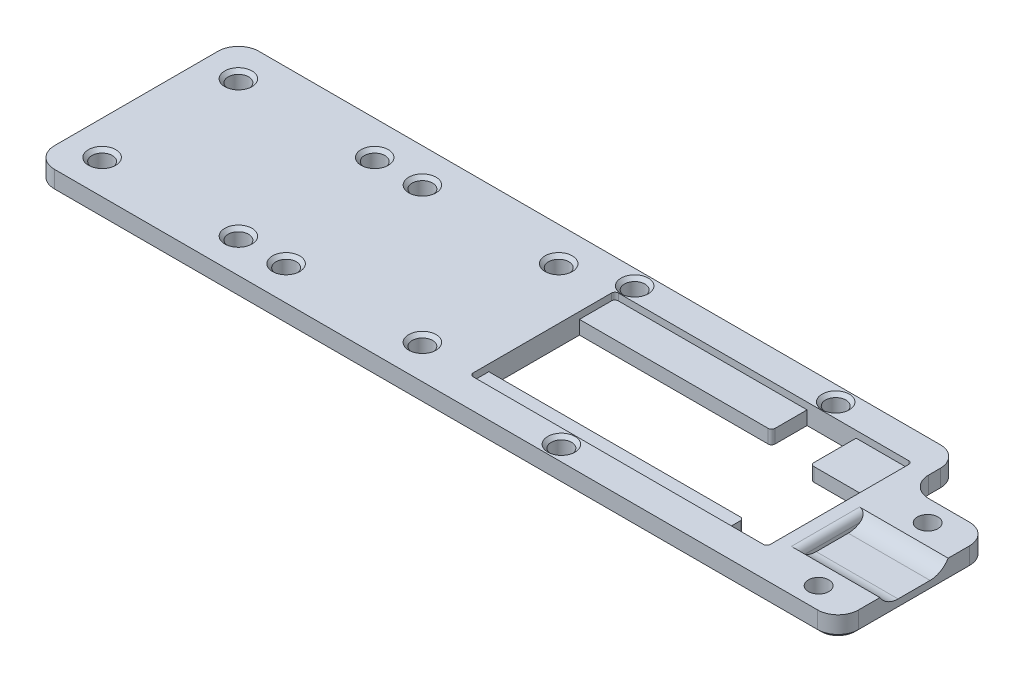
ISO-10303-21;
HEADER;
FILE_DESCRIPTION(('STEP AP214'),'2;1');
FILE_NAME('part.step','',(''),(''),'','','');
FILE_SCHEMA(('AUTOMOTIVE_DESIGN { 1 0 10303 214 1 1 1 1 }'));
ENDSEC;
DATA;
#1=APPLICATION_CONTEXT('core data for automotive mechanical design processes');
#2=APPLICATION_PROTOCOL_DEFINITION('international standard','automotive_design',2000,#1);
#3=PRODUCT_CONTEXT('',#1,'mechanical');
#4=PRODUCT('Part','Part','',(#3));
#5=PRODUCT_RELATED_PRODUCT_CATEGORY('part','',(#4));
#6=PRODUCT_DEFINITION_FORMATION('','',#4);
#7=PRODUCT_DEFINITION_CONTEXT('part definition',#1,'design');
#8=PRODUCT_DEFINITION('design','',#6,#7);
#9=PRODUCT_DEFINITION_SHAPE('','',#8);
#10=(LENGTH_UNIT() NAMED_UNIT(*) SI_UNIT(.MILLI.,.METRE.));
#11=(NAMED_UNIT(*) PLANE_ANGLE_UNIT() SI_UNIT($,.RADIAN.));
#12=(NAMED_UNIT(*) SI_UNIT($,.STERADIAN.) SOLID_ANGLE_UNIT());
#13=UNCERTAINTY_MEASURE_WITH_UNIT(LENGTH_MEASURE(1.E-05),#10,'distance_accuracy_value','');
#14=(GEOMETRIC_REPRESENTATION_CONTEXT(3) GLOBAL_UNCERTAINTY_ASSIGNED_CONTEXT((#13)) GLOBAL_UNIT_ASSIGNED_CONTEXT((#10,
#11,#12)) REPRESENTATION_CONTEXT('',''));
#15=CARTESIAN_POINT('',(0.,0.,0.));
#16=DIRECTION('',(0.,0.,1.));
#17=DIRECTION('',(1.,0.,0.));
#18=AXIS2_PLACEMENT_3D('',#15,#16,#17);
#19=CARTESIAN_POINT('',(53.,3.00000000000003,15.));
#20=DIRECTION('',(-1.,0.,0.));
#21=DIRECTION('',(0.,0.,1.));
#22=AXIS2_PLACEMENT_3D('',#19,#20,#21);
#23=PLANE('',#22);
#24=CARTESIAN_POINT('',(53.,4.60000000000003,1.5));
#25=DIRECTION('',(1.,0.,0.));
#26=DIRECTION('',(0.,0.,-1.));
#27=AXIS2_PLACEMENT_3D('',#24,#25,#26);
#28=CIRCLE('',#27,3.1);
#29=CARTESIAN_POINT('',(53.,1.50000000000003,1.5));
#30=VERTEX_POINT('',#29);
#31=CARTESIAN_POINT('',(53.,2.00000000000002,-0.188194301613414));
#32=VERTEX_POINT('',#31);
#33=EDGE_CURVE('E374',#30,#32,#28,.T.);
#34=ORIENTED_EDGE('',*,*,#33,.T.);
#35=DIRECTION('',(0.,0.,-1.));
#36=VECTOR('',#35,1.);
#37=CARTESIAN_POINT('',(53.,2.00000000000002,8.85518360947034));
#38=LINE('',#37,#36);
#39=CARTESIAN_POINT('',(53.,2.00000000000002,7.8881943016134));
#40=VERTEX_POINT('',#39);
#41=EDGE_CURVE('E347',#32,#40,#38,.F.);
#42=ORIENTED_EDGE('',*,*,#41,.T.);
#43=CARTESIAN_POINT('',(53.,4.60000000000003,6.19999999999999));
#44=DIRECTION('',(1.,0.,0.));
#45=DIRECTION('',(0.,0.,-1.));
#46=AXIS2_PLACEMENT_3D('',#43,#44,#45);
#47=CIRCLE('',#46,3.1);
#48=CARTESIAN_POINT('',(53.,1.50000000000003,6.19999999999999));
#49=VERTEX_POINT('',#48);
#50=EDGE_CURVE('E365',#40,#49,#47,.T.);
#51=ORIENTED_EDGE('',*,*,#50,.T.);
#52=DIRECTION('',(0.,0.,-1.));
#53=VECTOR('',#52,1.);
#54=CARTESIAN_POINT('',(53.,1.50000000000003,6.19999999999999));
#55=LINE('',#54,#53);
#56=EDGE_CURVE('E370',#49,#30,#55,.T.);
#57=ORIENTED_EDGE('',*,*,#56,.T.);
#58=EDGE_LOOP('',(#34,#42,#51,#57));
#59=FACE_BOUND('',#58,.T.);
#60=ADVANCED_FACE('F42',(#59),#23,.F.);
#61=CARTESIAN_POINT('',(7.1,2.00000000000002,-10.15));
#62=DIRECTION('',(0.,-1.,0.));
#63=DIRECTION('',(0.,0.,-1.));
#64=AXIS2_PLACEMENT_3D('',#61,#62,#63);
#65=PLANE('',#64);
#66=DIRECTION('',(0.,0.,1.));
#67=VECTOR('',#66,1.);
#68=CARTESIAN_POINT('',(44.,2.00000000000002,7.84999999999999));
#69=LINE('',#68,#67);
#70=CARTESIAN_POINT('',(44.,2.00000000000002,8.34999999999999));
#71=VERTEX_POINT('',#70);
#72=CARTESIAN_POINT('',(44.,2.00000000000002,10.65));
#73=VERTEX_POINT('',#72);
#74=EDGE_CURVE('E475',#71,#73,#69,.T.);
#75=ORIENTED_EDGE('',*,*,#74,.F.);
#76=CARTESIAN_POINT('',(43.5,2.00000000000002,8.34999999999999));
#77=DIRECTION('',(0.,-1.,0.));
#78=DIRECTION('',(0.,0.,-1.));
#79=AXIS2_PLACEMENT_3D('',#76,#77,#78);
#80=CIRCLE('',#79,0.5);
#81=CARTESIAN_POINT('',(43.5,2.00000000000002,7.84999999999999));
#82=VERTEX_POINT('',#81);
#83=EDGE_CURVE('E631',#71,#82,#80,.F.);
#84=ORIENTED_EDGE('',*,*,#83,.T.);
#85=DIRECTION('',(1.,0.,0.));
#86=VECTOR('',#85,1.);
#87=CARTESIAN_POINT('',(6.59999999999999,2.00000000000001,7.85));
#88=LINE('',#87,#86);
#89=CARTESIAN_POINT('',(6.59999999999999,2.00000000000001,7.85));
#90=VERTEX_POINT('',#89);
#91=EDGE_CURVE('E471',#90,#82,#88,.T.);
#92=ORIENTED_EDGE('',*,*,#91,.F.);
#93=DIRECTION('',(0.,0.,0.999999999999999));
#94=VECTOR('',#93,1.);
#95=CARTESIAN_POINT('',(6.59999999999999,2.00000000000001,-10.15));
#96=LINE('',#95,#94);
#97=CARTESIAN_POINT('',(6.59999999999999,2.00000000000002,10.15));
#98=VERTEX_POINT('',#97);
#99=EDGE_CURVE('E513',#90,#98,#96,.T.);
#100=ORIENTED_EDGE('',*,*,#99,.T.);
#101=CARTESIAN_POINT('',(7.1,2.00000000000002,10.15));
#102=DIRECTION('',(0.,1.,0.));
#103=DIRECTION('',(0.,0.,1.));
#104=AXIS2_PLACEMENT_3D('',#101,#102,#103);
#105=CIRCLE('',#104,0.5);
#106=CARTESIAN_POINT('',(7.1,2.00000000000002,10.65));
#107=VERTEX_POINT('',#106);
#108=EDGE_CURVE('E519',#98,#107,#105,.T.);
#109=ORIENTED_EDGE('',*,*,#108,.T.);
#110=DIRECTION('',(1.,0.,0.));
#111=VECTOR('',#110,1.);
#112=CARTESIAN_POINT('',(7.1,2.00000000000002,10.65));
#113=LINE('',#112,#111);
#114=EDGE_CURVE('E523',#107,#73,#113,.T.);
#115=ORIENTED_EDGE('',*,*,#114,.T.);
#116=EDGE_LOOP('',(#75,#84,#92,#100,#109,#115));
#117=FACE_BOUND('',#116,.T.);
#118=ADVANCED_FACE('F849',(#117),#65,.F.);
#119=DIRECTION('',(0.,0.,-0.999999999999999));
#120=VECTOR('',#119,1.);
#121=CARTESIAN_POINT('',(42.,2.00000000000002,-10.65));
#122=LINE('',#121,#120);
#123=CARTESIAN_POINT('',(42.,2.00000000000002,-4.44999999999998));
#124=VERTEX_POINT('',#123);
#125=CARTESIAN_POINT('',(42.,2.00000000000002,-10.65));
#126=VERTEX_POINT('',#125);
#127=EDGE_CURVE('E482',#124,#126,#122,.T.);
#128=ORIENTED_EDGE('',*,*,#127,.F.);
#129=CARTESIAN_POINT('',(42.5,2.00000000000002,-4.44999999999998));
#130=DIRECTION('',(0.,-1.,0.));
#131=DIRECTION('',(0.,0.,-1.));
#132=AXIS2_PLACEMENT_3D('',#129,#130,#131);
#133=CIRCLE('',#132,0.5);
#134=CARTESIAN_POINT('',(42.5,2.00000000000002,-3.94999999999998));
#135=VERTEX_POINT('',#134);
#136=EDGE_CURVE('E612',#124,#135,#133,.F.);
#137=ORIENTED_EDGE('',*,*,#136,.T.);
#138=DIRECTION('',(-1.,0.,0.));
#139=VECTOR('',#138,1.);
#140=CARTESIAN_POINT('',(42.,2.00000000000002,-3.94999999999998));
#141=LINE('',#140,#139);
#142=CARTESIAN_POINT('',(50.2,2.00000000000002,-3.94999999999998));
#143=VERTEX_POINT('',#142);
#144=EDGE_CURVE('E478',#143,#135,#141,.T.);
#145=ORIENTED_EDGE('',*,*,#144,.F.);
#146=DIRECTION('',(0.,0.,-1.));
#147=VECTOR('',#146,1.);
#148=CARTESIAN_POINT('',(50.2,2.00000000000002,10.15));
#149=LINE('',#148,#147);
#150=CARTESIAN_POINT('',(50.2,2.00000000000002,-10.15));
#151=VERTEX_POINT('',#150);
#152=EDGE_CURVE('E527',#143,#151,#149,.T.);
#153=ORIENTED_EDGE('',*,*,#152,.T.);
#154=CARTESIAN_POINT('',(49.7,2.00000000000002,-10.15));
#155=DIRECTION('',(0.,1.,0.));
#156=DIRECTION('',(0.,0.,1.));
#157=AXIS2_PLACEMENT_3D('',#154,#155,#156);
#158=CIRCLE('',#157,0.5);
#159=CARTESIAN_POINT('',(49.7,2.00000000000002,-10.65));
#160=VERTEX_POINT('',#159);
#161=EDGE_CURVE('E530',#151,#160,#158,.T.);
#162=ORIENTED_EDGE('',*,*,#161,.T.);
#163=DIRECTION('',(-1.,0.,0.));
#164=VECTOR('',#163,1.);
#165=CARTESIAN_POINT('',(49.7,2.00000000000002,-10.65));
#166=LINE('',#165,#164);
#167=EDGE_CURVE('E535',#160,#126,#166,.T.);
#168=ORIENTED_EDGE('',*,*,#167,.T.);
#169=EDGE_LOOP('',(#128,#137,#145,#153,#162,#168));
#170=FACE_BOUND('',#169,.T.);
#171=ADVANCED_FACE('F852',(#170),#65,.F.);
#172=DIRECTION('',(-1.,0.,0.));
#173=VECTOR('',#172,1.);
#174=CARTESIAN_POINT('',(6.59999999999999,2.00000000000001,-5.44999999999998));
#175=LINE('',#174,#173);
#176=CARTESIAN_POINT('',(34.3,2.00000000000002,-5.44999999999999));
#177=VERTEX_POINT('',#176);
#178=CARTESIAN_POINT('',(6.59999999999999,2.00000000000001,-5.44999999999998));
#179=VERTEX_POINT('',#178);
#180=EDGE_CURVE('E425',#177,#179,#175,.T.);
#181=ORIENTED_EDGE('',*,*,#180,.F.);
#182=CARTESIAN_POINT('',(34.3,2.00000000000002,-5.94999999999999));
#183=DIRECTION('',(0.,-1.,0.));
#184=DIRECTION('',(0.,0.,-1.));
#185=AXIS2_PLACEMENT_3D('',#182,#183,#184);
#186=CIRCLE('',#185,0.5);
#187=CARTESIAN_POINT('',(34.8,2.00000000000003,-5.94999999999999));
#188=VERTEX_POINT('',#187);
#189=EDGE_CURVE('E641',#177,#188,#186,.F.);
#190=ORIENTED_EDGE('',*,*,#189,.T.);
#191=DIRECTION('',(0.,0.,0.999999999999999));
#192=VECTOR('',#191,1.);
#193=CARTESIAN_POINT('',(34.8,2.00000000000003,-5.44999999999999));
#194=LINE('',#193,#192);
#195=CARTESIAN_POINT('',(34.8,2.00000000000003,-10.65));
#196=VERTEX_POINT('',#195);
#197=EDGE_CURVE('E430',#196,#188,#194,.T.);
#198=ORIENTED_EDGE('',*,*,#197,.F.);
#199=CARTESIAN_POINT('',(7.1,2.00000000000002,-10.65));
#200=VERTEX_POINT('',#199);
#201=EDGE_CURVE('E534',#196,#200,#166,.T.);
#202=ORIENTED_EDGE('',*,*,#201,.T.);
#203=CARTESIAN_POINT('',(7.1,2.00000000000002,-10.15));
#204=DIRECTION('',(0.,1.,0.));
#205=DIRECTION('',(0.,0.,-1.));
#206=AXIS2_PLACEMENT_3D('',#203,#204,#205);
#207=CIRCLE('',#206,0.5);
#208=CARTESIAN_POINT('',(6.59999999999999,2.00000000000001,-10.15));
#209=VERTEX_POINT('',#208);
#210=EDGE_CURVE('E509',#200,#209,#207,.T.);
#211=ORIENTED_EDGE('',*,*,#210,.T.);
#212=EDGE_CURVE('E515',#209,#179,#96,.T.);
#213=ORIENTED_EDGE('',*,*,#212,.T.);
#214=EDGE_LOOP('',(#181,#190,#198,#202,#211,#213));
#215=FACE_BOUND('',#214,.T.);
#216=ADVANCED_FACE('F854',(#215),#65,.F.);
#217=CARTESIAN_POINT('',(-53.0000000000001,3.00000000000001,15.));
#218=DIRECTION('',(1.,0.,0.));
#219=DIRECTION('',(0.,0.,-1.));
#220=AXIS2_PLACEMENT_3D('',#217,#218,#219);
#221=PLANE('',#220);
#222=DIRECTION('',(0.,-1.,0.));
#223=VECTOR('',#222,1.);
#224=CARTESIAN_POINT('',(-53.0000000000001,3.00000000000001,-12.));
#225=LINE('',#224,#223);
#226=CARTESIAN_POINT('',(-53.0000000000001,3.00000000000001,-12.));
#227=VERTEX_POINT('',#226);
#228=CARTESIAN_POINT('',(-53.,0.49999999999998,-12.));
#229=VERTEX_POINT('',#228);
#230=EDGE_CURVE('E1014',#227,#229,#225,.T.);
#231=ORIENTED_EDGE('',*,*,#230,.T.);
#232=DIRECTION('',(0.,0.,1.));
#233=VECTOR('',#232,1.);
#234=CARTESIAN_POINT('',(-53.,0.49999999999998,15.));
#235=LINE('',#234,#233);
#236=CARTESIAN_POINT('',(-53.,0.49999999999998,12.));
#237=VERTEX_POINT('',#236);
#238=EDGE_CURVE('E1126',#229,#237,#235,.T.);
#239=ORIENTED_EDGE('',*,*,#238,.T.);
#240=DIRECTION('',(0.,-1.,0.));
#241=VECTOR('',#240,1.);
#242=CARTESIAN_POINT('',(-53.0000000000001,3.00000000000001,12.));
#243=LINE('',#242,#241);
#244=CARTESIAN_POINT('',(-53.0000000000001,3.00000000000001,12.));
#245=VERTEX_POINT('',#244);
#246=EDGE_CURVE('E1020',#237,#245,#243,.F.);
#247=ORIENTED_EDGE('',*,*,#246,.T.);
#248=DIRECTION('',(0.,0.,1.));
#249=VECTOR('',#248,1.);
#250=CARTESIAN_POINT('',(-53.0000000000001,3.00000000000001,15.));
#251=LINE('',#250,#249);
#252=EDGE_CURVE('E572',#227,#245,#251,.T.);
#253=ORIENTED_EDGE('',*,*,#252,.F.);
#254=EDGE_LOOP('',(#231,#239,#247,#253));
#255=FACE_BOUND('',#254,.T.);
#256=ADVANCED_FACE('F904',(#255),#221,.F.);
#257=CARTESIAN_POINT('',(53.,3.00000000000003,15.));
#258=DIRECTION('',(0.,0.,-1.));
#259=DIRECTION('',(-1.,0.,0.));
#260=AXIS2_PLACEMENT_3D('',#257,#258,#259);
#261=PLANE('',#260);
#262=DIRECTION('',(0.,-1.,0.));
#263=VECTOR('',#262,1.);
#264=CARTESIAN_POINT('',(-50.,3.,15.));
#265=LINE('',#264,#263);
#266=CARTESIAN_POINT('',(-50.,3.,15.));
#267=VERTEX_POINT('',#266);
#268=CARTESIAN_POINT('',(-50.,0.499999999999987,15.));
#269=VERTEX_POINT('',#268);
#270=EDGE_CURVE('E1010',#267,#269,#265,.T.);
#271=ORIENTED_EDGE('',*,*,#270,.T.);
#272=DIRECTION('',(1.,0.,0.));
#273=VECTOR('',#272,1.);
#274=CARTESIAN_POINT('',(53.,0.500000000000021,15.));
#275=LINE('',#274,#273);
#276=CARTESIAN_POINT('',(62.,0.500000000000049,15.));
#277=VERTEX_POINT('',#276);
#278=EDGE_CURVE('E11',#269,#277,#275,.T.);
#279=ORIENTED_EDGE('',*,*,#278,.T.);
#280=DIRECTION('',(0.,-1.,0.));
#281=VECTOR('',#280,1.);
#282=CARTESIAN_POINT('',(62.,3.00000000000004,15.));
#283=LINE('',#282,#281);
#284=CARTESIAN_POINT('',(62.,3.00000000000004,15.));
#285=VERTEX_POINT('',#284);
#286=EDGE_CURVE('E1007',#277,#285,#283,.F.);
#287=ORIENTED_EDGE('',*,*,#286,.T.);
#288=DIRECTION('',(1.,0.,0.));
#289=VECTOR('',#288,1.);
#290=CARTESIAN_POINT('',(53.,3.00000000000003,15.));
#291=LINE('',#290,#289);
#292=EDGE_CURVE('E596',#267,#285,#291,.T.);
#293=ORIENTED_EDGE('',*,*,#292,.F.);
#294=EDGE_LOOP('',(#271,#279,#287,#293));
#295=FACE_BOUND('',#294,.T.);
#296=ADVANCED_FACE('F900',(#295),#261,.F.);
#297=DIRECTION('',(0.,-1.,0.));
#298=VECTOR('',#297,1.);
#299=CARTESIAN_POINT('',(53.,3.00000000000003,-10.3));
#300=LINE('',#299,#298);
#301=CARTESIAN_POINT('',(53.,3.00000000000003,-10.3));
#302=VERTEX_POINT('',#301);
#303=CARTESIAN_POINT('',(53.,0.500000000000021,-10.3));
#304=VERTEX_POINT('',#303);
#305=EDGE_CURVE('E1048',#302,#304,#300,.T.);
#306=ORIENTED_EDGE('',*,*,#305,.T.);
#307=DIRECTION('',(0.,0.,-1.));
#308=VECTOR('',#307,1.);
#309=CARTESIAN_POINT('',(53.,0.500000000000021,15.));
#310=LINE('',#309,#308);
#311=CARTESIAN_POINT('',(53.,0.500000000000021,-12.));
#312=VERTEX_POINT('',#311);
#313=EDGE_CURVE('E1067',#304,#312,#310,.T.);
#314=ORIENTED_EDGE('',*,*,#313,.T.);
#315=DIRECTION('',(0.,-1.,0.));
#316=VECTOR('',#315,1.);
#317=CARTESIAN_POINT('',(53.,3.00000000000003,-12.));
#318=LINE('',#317,#316);
#319=CARTESIAN_POINT('',(53.,3.00000000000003,-12.));
#320=VERTEX_POINT('',#319);
#321=EDGE_CURVE('E1045',#312,#320,#318,.F.);
#322=ORIENTED_EDGE('',*,*,#321,.T.);
#323=DIRECTION('',(0.,0.,-1.));
#324=VECTOR('',#323,1.);
#325=CARTESIAN_POINT('',(53.,3.00000000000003,15.));
#326=LINE('',#325,#324);
#327=EDGE_CURVE('E600',#302,#320,#326,.T.);
#328=ORIENTED_EDGE('',*,*,#327,.F.);
#329=EDGE_LOOP('',(#306,#314,#322,#328));
#330=FACE_BOUND('',#329,.T.);
#331=ADVANCED_FACE('F896',(#330),#23,.F.);
#332=CARTESIAN_POINT('',(53.,3.00000000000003,-15.));
#333=DIRECTION('',(0.,0.,1.));
#334=DIRECTION('',(1.,0.,0.));
#335=AXIS2_PLACEMENT_3D('',#332,#333,#334);
#336=PLANE('',#335);
#337=DIRECTION('',(0.,-1.,0.));
#338=VECTOR('',#337,1.);
#339=CARTESIAN_POINT('',(50.,3.00000000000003,-15.));
#340=LINE('',#339,#338);
#341=CARTESIAN_POINT('',(50.,3.00000000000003,-15.));
#342=VERTEX_POINT('',#341);
#343=CARTESIAN_POINT('',(50.,0.500000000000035,-15.));
#344=VERTEX_POINT('',#343);
#345=EDGE_CURVE('E1038',#342,#344,#340,.T.);
#346=ORIENTED_EDGE('',*,*,#345,.T.);
#347=DIRECTION('',(-1.,0.,0.));
#348=VECTOR('',#347,1.);
#349=CARTESIAN_POINT('',(53.,0.500000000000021,-15.));
#350=LINE('',#349,#348);
#351=CARTESIAN_POINT('',(-50.,0.499999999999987,-15.));
#352=VERTEX_POINT('',#351);
#353=EDGE_CURVE('E1114',#344,#352,#350,.T.);
#354=ORIENTED_EDGE('',*,*,#353,.T.);
#355=DIRECTION('',(0.,-1.,0.));
#356=VECTOR('',#355,1.);
#357=CARTESIAN_POINT('',(-50.,3.,-15.));
#358=LINE('',#357,#356);
#359=CARTESIAN_POINT('',(-50.,3.,-15.));
#360=VERTEX_POINT('',#359);
#361=EDGE_CURVE('E1042',#352,#360,#358,.F.);
#362=ORIENTED_EDGE('',*,*,#361,.T.);
#363=DIRECTION('',(-1.,0.,0.));
#364=VECTOR('',#363,1.);
#365=CARTESIAN_POINT('',(53.,3.00000000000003,-15.));
#366=LINE('',#365,#364);
#367=EDGE_CURVE('E604',#342,#360,#366,.T.);
#368=ORIENTED_EDGE('',*,*,#367,.F.);
#369=EDGE_LOOP('',(#346,#354,#362,#368));
#370=FACE_BOUND('',#369,.T.);
#371=ADVANCED_FACE('F889',(#370),#336,.F.);
#372=CARTESIAN_POINT('',(0.,3.00000000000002,0.));
#373=DIRECTION('',(0.,1.,0.));
#374=DIRECTION('',(0.,0.,1.));
#375=AXIS2_PLACEMENT_3D('',#372,#373,#374);
#376=PLANE('',#375);
#377=CARTESIAN_POINT('',(59.,3.00000000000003,-4.15));
#378=DIRECTION('',(0.,-1.,0.));
#379=DIRECTION('',(0.,0.,-1.));
#380=AXIS2_PLACEMENT_3D('',#377,#378,#379);
#381=CIRCLE('',#380,1.5);
#382=CARTESIAN_POINT('',(59.,3.00000000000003,-5.65));
#383=VERTEX_POINT('',#382);
#384=EDGE_CURVE('E1203',#383,#383,#381,.T.);
#385=ORIENTED_EDGE('',*,*,#384,.T.);
#386=EDGE_LOOP('',(#385));
#387=FACE_BOUND('',#386,.T.);
#388=CARTESIAN_POINT('',(59.,3.00000000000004,11.85));
#389=DIRECTION('',(0.,-1.,0.));
#390=DIRECTION('',(0.,0.,-1.));
#391=AXIS2_PLACEMENT_3D('',#388,#389,#390);
#392=CIRCLE('',#391,1.5);
#393=CARTESIAN_POINT('',(59.,3.00000000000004,10.35));
#394=VERTEX_POINT('',#393);
#395=EDGE_CURVE('E1190',#394,#394,#392,.T.);
#396=ORIENTED_EDGE('',*,*,#395,.T.);
#397=EDGE_LOOP('',(#396));
#398=FACE_BOUND('',#397,.T.);
#399=ORIENTED_EDGE('',*,*,#252,.T.);
#400=CARTESIAN_POINT('',(-50.,3.,12.));
#401=DIRECTION('',(0.,1.,0.));
#402=DIRECTION('',(0.,0.,1.));
#403=AXIS2_PLACEMENT_3D('',#400,#401,#402);
#404=CIRCLE('',#403,3.);
#405=EDGE_CURVE('E1035',#245,#267,#404,.T.);
#406=ORIENTED_EDGE('',*,*,#405,.T.);
#407=ORIENTED_EDGE('',*,*,#292,.T.);
#408=CARTESIAN_POINT('',(62.,3.00000000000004,12.));
#409=DIRECTION('',(0.,1.,0.));
#410=DIRECTION('',(0.,0.,1.));
#411=AXIS2_PLACEMENT_3D('',#408,#409,#410);
#412=CIRCLE('',#411,3.);
#413=CARTESIAN_POINT('',(65.,3.00000000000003,12.));
#414=VERTEX_POINT('',#413);
#415=EDGE_CURVE('E1026',#285,#414,#412,.T.);
#416=ORIENTED_EDGE('',*,*,#415,.T.);
#417=DIRECTION('',(0.,0.,-1.));
#418=VECTOR('',#417,1.);
#419=CARTESIAN_POINT('',(65.,3.00000000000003,0.));
#420=LINE('',#419,#418);
#421=CARTESIAN_POINT('',(65.,3.00000000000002,8.85518360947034));
#422=VERTEX_POINT('',#421);
#423=EDGE_CURVE('E333',#414,#422,#420,.T.);
#424=ORIENTED_EDGE('',*,*,#423,.T.);
#425=DIRECTION('',(-1.,0.,0.));
#426=VECTOR('',#425,1.);
#427=CARTESIAN_POINT('',(53.,3.00000000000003,8.85518360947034));
#428=LINE('',#427,#426);
#429=CARTESIAN_POINT('',(52.,3.00000000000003,8.85518360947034));
#430=VERTEX_POINT('',#429);
#431=EDGE_CURVE('E368',#422,#430,#428,.T.);
#432=ORIENTED_EDGE('',*,*,#431,.T.);
#433=DIRECTION('',(0.,0.,-1.));
#434=VECTOR('',#433,1.);
#435=CARTESIAN_POINT('',(52.,3.00000000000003,-1.15518360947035));
#436=LINE('',#435,#434);
#437=CARTESIAN_POINT('',(52.,3.00000000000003,-1.15518360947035));
#438=VERTEX_POINT('',#437);
#439=EDGE_CURVE('E344',#430,#438,#436,.T.);
#440=ORIENTED_EDGE('',*,*,#439,.T.);
#441=DIRECTION('',(-1.,0.,0.));
#442=VECTOR('',#441,1.);
#443=CARTESIAN_POINT('',(52.,3.00000000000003,-1.15518360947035));
#444=LINE('',#443,#442);
#445=CARTESIAN_POINT('',(65.,3.00000000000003,-1.15518360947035));
#446=VERTEX_POINT('',#445);
#447=EDGE_CURVE('E338',#438,#446,#444,.F.);
#448=ORIENTED_EDGE('',*,*,#447,.T.);
#449=DIRECTION('',(0.,0.,-1.));
#450=VECTOR('',#449,1.);
#451=CARTESIAN_POINT('',(65.,3.00000000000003,0.));
#452=LINE('',#451,#450);
#453=CARTESIAN_POINT('',(65.,3.00000000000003,-4.3));
#454=VERTEX_POINT('',#453);
#455=EDGE_CURVE('E321',#446,#454,#452,.T.);
#456=ORIENTED_EDGE('',*,*,#455,.T.);
#457=CARTESIAN_POINT('',(62.,3.00000000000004,-4.3));
#458=DIRECTION('',(0.,1.,0.));
#459=DIRECTION('',(0.,0.,1.));
#460=AXIS2_PLACEMENT_3D('',#457,#458,#459);
#461=CIRCLE('',#460,3.);
#462=CARTESIAN_POINT('',(62.,3.00000000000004,-7.3));
#463=VERTEX_POINT('',#462);
#464=EDGE_CURVE('E1023',#454,#463,#461,.T.);
#465=ORIENTED_EDGE('',*,*,#464,.T.);
#466=DIRECTION('',(1.,0.,0.));
#467=VECTOR('',#466,1.);
#468=CARTESIAN_POINT('',(0.,3.00000000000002,-7.30000000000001));
#469=LINE('',#468,#467);
#470=CARTESIAN_POINT('',(56.,3.00000000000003,-7.3));
#471=VERTEX_POINT('',#470);
#472=EDGE_CURVE('E334',#471,#463,#469,.T.);
#473=ORIENTED_EDGE('',*,*,#472,.F.);
#474=CARTESIAN_POINT('',(56.,3.00000000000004,-10.3));
#475=DIRECTION('',(0.,1.,0.));
#476=DIRECTION('',(0.,0.,1.));
#477=AXIS2_PLACEMENT_3D('',#474,#475,#476);
#478=CIRCLE('',#477,3.);
#479=EDGE_CURVE('E1064',#471,#302,#478,.F.);
#480=ORIENTED_EDGE('',*,*,#479,.T.);
#481=ORIENTED_EDGE('',*,*,#327,.T.);
#482=CARTESIAN_POINT('',(50.,3.00000000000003,-12.));
#483=DIRECTION('',(0.,1.,0.));
#484=DIRECTION('',(0.,0.,1.));
#485=AXIS2_PLACEMENT_3D('',#482,#483,#484);
#486=CIRCLE('',#485,3.);
#487=EDGE_CURVE('E1029',#320,#342,#486,.T.);
#488=ORIENTED_EDGE('',*,*,#487,.T.);
#489=ORIENTED_EDGE('',*,*,#367,.T.);
#490=CARTESIAN_POINT('',(-50.,3.,-12.));
#491=DIRECTION('',(0.,1.,0.));
#492=DIRECTION('',(0.,0.,1.));
#493=AXIS2_PLACEMENT_3D('',#490,#491,#492);
#494=CIRCLE('',#493,3.);
#495=EDGE_CURVE('E1032',#360,#227,#494,.T.);
#496=ORIENTED_EDGE('',*,*,#495,.T.);
#497=EDGE_LOOP('',(#399,#406,#407,#416,#424,#432,#440,#448,#456,#465,#473,#480,#481,#488,#489,#496));
#498=FACE_BOUND('',#497,.T.);
#499=CARTESIAN_POINT('',(22.15,3.00000000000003,12.75));
#500=DIRECTION('',(0.,1.,0.));
#501=DIRECTION('',(0.,0.,1.));
#502=AXIS2_PLACEMENT_3D('',#499,#500,#501);
#503=CIRCLE('',#502,2.00000000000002);
#504=CARTESIAN_POINT('',(22.15,3.00000000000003,14.75));
#505=VERTEX_POINT('',#504);
#506=EDGE_CURVE('E691',#505,#505,#503,.F.);
#507=ORIENTED_EDGE('',*,*,#506,.T.);
#508=EDGE_LOOP('',(#507));
#509=FACE_BOUND('',#508,.T.);
#510=CARTESIAN_POINT('',(-48.,2.99999999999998,9.99999999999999));
#511=DIRECTION('',(0.,1.,0.));
#512=DIRECTION('',(0.,0.,1.));
#513=AXIS2_PLACEMENT_3D('',#510,#511,#512);
#514=CIRCLE('',#513,2.00000000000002);
#515=CARTESIAN_POINT('',(-48.,2.99999999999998,12.));
#516=VERTEX_POINT('',#515);
#517=EDGE_CURVE('E687',#516,#516,#514,.F.);
#518=ORIENTED_EDGE('',*,*,#517,.T.);
#519=EDGE_LOOP('',(#518));
#520=FACE_BOUND('',#519,.T.);
#521=CARTESIAN_POINT('',(-28.,2.99999999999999,9.99999999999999));
#522=DIRECTION('',(0.,1.,0.));
#523=DIRECTION('',(0.,0.,1.));
#524=AXIS2_PLACEMENT_3D('',#521,#522,#523);
#525=CIRCLE('',#524,2.00000000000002);
#526=CARTESIAN_POINT('',(-28.,2.99999999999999,12.));
#527=VERTEX_POINT('',#526);
#528=EDGE_CURVE('E683',#527,#527,#525,.F.);
#529=ORIENTED_EDGE('',*,*,#528,.T.);
#530=EDGE_LOOP('',(#529));
#531=FACE_BOUND('',#530,.T.);
#532=CARTESIAN_POINT('',(-21.,2.99999999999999,9.99999999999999));
#533=DIRECTION('',(0.,1.,0.));
#534=DIRECTION('',(0.,0.,1.));
#535=AXIS2_PLACEMENT_3D('',#532,#533,#534);
#536=CIRCLE('',#535,2.00000000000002);
#537=CARTESIAN_POINT('',(-21.,2.99999999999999,12.));
#538=VERTEX_POINT('',#537);
#539=EDGE_CURVE('E679',#538,#538,#536,.F.);
#540=ORIENTED_EDGE('',*,*,#539,.T.);
#541=EDGE_LOOP('',(#540));
#542=FACE_BOUND('',#541,.T.);
#543=CARTESIAN_POINT('',(-1.,2.99999999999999,9.99999999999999));
#544=DIRECTION('',(0.,1.,0.));
#545=DIRECTION('',(0.,0.,1.));
#546=AXIS2_PLACEMENT_3D('',#543,#544,#545);
#547=CIRCLE('',#546,2.00000000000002);
#548=CARTESIAN_POINT('',(-1.,2.99999999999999,12.));
#549=VERTEX_POINT('',#548);
#550=EDGE_CURVE('E675',#549,#549,#547,.F.);
#551=ORIENTED_EDGE('',*,*,#550,.T.);
#552=EDGE_LOOP('',(#551));
#553=FACE_BOUND('',#552,.T.);
#554=CARTESIAN_POINT('',(36.9,3.00000000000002,-12.75));
#555=DIRECTION('',(0.,1.,0.));
#556=DIRECTION('',(0.,0.,1.));
#557=AXIS2_PLACEMENT_3D('',#554,#555,#556);
#558=CIRCLE('',#557,2.00000000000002);
#559=CARTESIAN_POINT('',(36.9,3.00000000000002,-10.75));
#560=VERTEX_POINT('',#559);
#561=EDGE_CURVE('E671',#560,#560,#558,.F.);
#562=ORIENTED_EDGE('',*,*,#561,.T.);
#563=EDGE_LOOP('',(#562));
#564=FACE_BOUND('',#563,.T.);
#565=CARTESIAN_POINT('',(7.4,3.00000000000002,-12.75));
#566=DIRECTION('',(0.,1.,0.));
#567=DIRECTION('',(0.,0.,1.));
#568=AXIS2_PLACEMENT_3D('',#565,#566,#567);
#569=CIRCLE('',#568,2.00000000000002);
#570=CARTESIAN_POINT('',(7.4,3.00000000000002,-10.75));
#571=VERTEX_POINT('',#570);
#572=EDGE_CURVE('E667',#571,#571,#569,.F.);
#573=ORIENTED_EDGE('',*,*,#572,.T.);
#574=EDGE_LOOP('',(#573));
#575=FACE_BOUND('',#574,.T.);
#576=CARTESIAN_POINT('',(-1.,2.99999999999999,-10.));
#577=DIRECTION('',(0.,1.,0.));
#578=DIRECTION('',(0.,0.,1.));
#579=AXIS2_PLACEMENT_3D('',#576,#577,#578);
#580=CIRCLE('',#579,2.00000000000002);
#581=CARTESIAN_POINT('',(-1.,2.99999999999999,-7.99999999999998));
#582=VERTEX_POINT('',#581);
#583=EDGE_CURVE('E663',#582,#582,#580,.F.);
#584=ORIENTED_EDGE('',*,*,#583,.T.);
#585=EDGE_LOOP('',(#584));
#586=FACE_BOUND('',#585,.T.);
#587=CARTESIAN_POINT('',(-21.,2.99999999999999,-10.));
#588=DIRECTION('',(0.,1.,0.));
#589=DIRECTION('',(0.,0.,1.));
#590=AXIS2_PLACEMENT_3D('',#587,#588,#589);
#591=CIRCLE('',#590,2.00000000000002);
#592=CARTESIAN_POINT('',(-21.,2.99999999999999,-7.99999999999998));
#593=VERTEX_POINT('',#592);
#594=EDGE_CURVE('E659',#593,#593,#591,.F.);
#595=ORIENTED_EDGE('',*,*,#594,.T.);
#596=EDGE_LOOP('',(#595));
#597=FACE_BOUND('',#596,.T.);
#598=CARTESIAN_POINT('',(-28.,2.99999999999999,-10.));
#599=DIRECTION('',(0.,1.,0.));
#600=DIRECTION('',(0.,0.,1.));
#601=AXIS2_PLACEMENT_3D('',#598,#599,#600);
#602=CIRCLE('',#601,2.00000000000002);
#603=CARTESIAN_POINT('',(-28.,2.99999999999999,-7.99999999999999));
#604=VERTEX_POINT('',#603);
#605=EDGE_CURVE('E655',#604,#604,#602,.F.);
#606=ORIENTED_EDGE('',*,*,#605,.T.);
#607=EDGE_LOOP('',(#606));
#608=FACE_BOUND('',#607,.T.);
#609=CARTESIAN_POINT('',(-48.,2.99999999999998,-9.99999999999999));
#610=DIRECTION('',(0.,1.,0.));
#611=DIRECTION('',(0.,0.,1.));
#612=AXIS2_PLACEMENT_3D('',#609,#610,#611);
#613=CIRCLE('',#612,2.00000000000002);
#614=CARTESIAN_POINT('',(-48.,2.99999999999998,-7.99999999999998));
#615=VERTEX_POINT('',#614);
#616=EDGE_CURVE('E651',#615,#615,#613,.F.);
#617=ORIENTED_EDGE('',*,*,#616,.T.);
#618=EDGE_LOOP('',(#617));
#619=FACE_BOUND('',#618,.T.);
#620=CARTESIAN_POINT('',(7.1,3.,-10.15));
#621=DIRECTION('',(0.,1.,0.));
#622=DIRECTION('',(0.,0.,-1.));
#623=AXIS2_PLACEMENT_3D('',#620,#621,#622);
#624=CIRCLE('',#623,0.5);
#625=CARTESIAN_POINT('',(7.1,3.,-10.65));
#626=VERTEX_POINT('',#625);
#627=CARTESIAN_POINT('',(6.59999999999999,3.,-10.15));
#628=VERTEX_POINT('',#627);
#629=EDGE_CURVE('E491',#626,#628,#624,.T.);
#630=ORIENTED_EDGE('',*,*,#629,.F.);
#631=DIRECTION('',(-1.,0.,0.));
#632=VECTOR('',#631,1.);
#633=CARTESIAN_POINT('',(49.7,3.00000000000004,-10.65));
#634=LINE('',#633,#632);
#635=CARTESIAN_POINT('',(49.7,3.00000000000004,-10.65));
#636=VERTEX_POINT('',#635);
#637=EDGE_CURVE('E514',#636,#626,#634,.T.);
#638=ORIENTED_EDGE('',*,*,#637,.F.);
#639=CARTESIAN_POINT('',(49.7,3.00000000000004,-10.15));
#640=DIRECTION('',(0.,1.,0.));
#641=DIRECTION('',(0.,0.,1.));
#642=AXIS2_PLACEMENT_3D('',#639,#640,#641);
#643=CIRCLE('',#642,0.5);
#644=CARTESIAN_POINT('',(50.2,3.00000000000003,-10.15));
#645=VERTEX_POINT('',#644);
#646=EDGE_CURVE('E562',#645,#636,#643,.T.);
#647=ORIENTED_EDGE('',*,*,#646,.F.);
#648=DIRECTION('',(0.,0.,-1.));
#649=VECTOR('',#648,1.);
#650=CARTESIAN_POINT('',(50.2,3.00000000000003,10.15));
#651=LINE('',#650,#649);
#652=CARTESIAN_POINT('',(50.2,3.00000000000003,10.15));
#653=VERTEX_POINT('',#652);
#654=EDGE_CURVE('E558',#653,#645,#651,.T.);
#655=ORIENTED_EDGE('',*,*,#654,.F.);
#656=CARTESIAN_POINT('',(49.7,3.00000000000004,10.15));
#657=DIRECTION('',(0.,1.,0.));
#658=DIRECTION('',(0.,0.,-1.));
#659=AXIS2_PLACEMENT_3D('',#656,#657,#658);
#660=CIRCLE('',#659,0.5);
#661=CARTESIAN_POINT('',(49.7,3.00000000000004,10.65));
#662=VERTEX_POINT('',#661);
#663=EDGE_CURVE('E554',#662,#653,#660,.T.);
#664=ORIENTED_EDGE('',*,*,#663,.F.);
#665=DIRECTION('',(1.,0.,0.));
#666=VECTOR('',#665,1.);
#667=CARTESIAN_POINT('',(7.1,3.,10.65));
#668=LINE('',#667,#666);
#669=CARTESIAN_POINT('',(7.1,3.,10.65));
#670=VERTEX_POINT('',#669);
#671=EDGE_CURVE('E550',#670,#662,#668,.T.);
#672=ORIENTED_EDGE('',*,*,#671,.F.);
#673=CARTESIAN_POINT('',(7.1,3.,10.15));
#674=DIRECTION('',(0.,1.,0.));
#675=DIRECTION('',(0.,0.,1.));
#676=AXIS2_PLACEMENT_3D('',#673,#674,#675);
#677=CIRCLE('',#676,0.5);
#678=CARTESIAN_POINT('',(6.59999999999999,3.,10.15));
#679=VERTEX_POINT('',#678);
#680=EDGE_CURVE('E546',#679,#670,#677,.T.);
#681=ORIENTED_EDGE('',*,*,#680,.F.);
#682=DIRECTION('',(0.,0.,0.999999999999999));
#683=VECTOR('',#682,1.);
#684=CARTESIAN_POINT('',(6.59999999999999,3.,-10.15));
#685=LINE('',#684,#683);
#686=EDGE_CURVE('E542',#628,#679,#685,.T.);
#687=ORIENTED_EDGE('',*,*,#686,.F.);
#688=EDGE_LOOP('',(#630,#638,#647,#655,#664,#672,#681,#687));
#689=FACE_BOUND('',#688,.T.);
#690=ADVANCED_FACE('F340',(#387,#398,#498,#509,#520,#531,#542,#553,#564,#575,#586,#597,#608,
#619,#689),#376,.T.);
#691=CARTESIAN_POINT('',(0.,0.,0.));
#692=DIRECTION('',(0.,1.,0.));
#693=DIRECTION('',(0.,0.,1.));
#694=AXIS2_PLACEMENT_3D('',#691,#692,#693);
#695=PLANE('',#694);
#696=CARTESIAN_POINT('',(50.,0.,-12.));
#697=DIRECTION('',(0.,1.,0.));
#698=DIRECTION('',(0.,0.,1.));
#699=AXIS2_PLACEMENT_3D('',#696,#697,#698);
#700=CIRCLE('',#699,2.5);
#701=CARTESIAN_POINT('',(50.,0.,-14.5));
#702=VERTEX_POINT('',#701);
#703=CARTESIAN_POINT('',(52.5,0.,-12.));
#704=VERTEX_POINT('',#703);
#705=EDGE_CURVE('E1101',#702,#704,#700,.F.);
#706=ORIENTED_EDGE('',*,*,#705,.T.);
#707=DIRECTION('',(0.,0.,1.));
#708=VECTOR('',#707,1.);
#709=CARTESIAN_POINT('',(52.5,0.,0.));
#710=LINE('',#709,#708);
#711=CARTESIAN_POINT('',(52.5,0.,-10.3));
#712=VERTEX_POINT('',#711);
#713=EDGE_CURVE('E1104',#704,#712,#710,.T.);
#714=ORIENTED_EDGE('',*,*,#713,.T.);
#715=CARTESIAN_POINT('',(56.,0.,-10.3));
#716=DIRECTION('',(0.,1.,0.));
#717=DIRECTION('',(0.,0.,1.));
#718=AXIS2_PLACEMENT_3D('',#715,#716,#717);
#719=CIRCLE('',#718,3.5);
#720=CARTESIAN_POINT('',(56.,0.,-6.8));
#721=VERTEX_POINT('',#720);
#722=EDGE_CURVE('E1098',#712,#721,#719,.T.);
#723=ORIENTED_EDGE('',*,*,#722,.T.);
#724=DIRECTION('',(1.,0.,0.));
#725=VECTOR('',#724,1.);
#726=CARTESIAN_POINT('',(62.,0.,-6.8));
#727=LINE('',#726,#725);
#728=CARTESIAN_POINT('',(62.,0.,-6.8));
#729=VERTEX_POINT('',#728);
#730=EDGE_CURVE('E1092',#721,#729,#727,.T.);
#731=ORIENTED_EDGE('',*,*,#730,.T.);
#732=CARTESIAN_POINT('',(62.,0.,-4.3));
#733=DIRECTION('',(0.,1.,0.));
#734=DIRECTION('',(0.,0.,1.));
#735=AXIS2_PLACEMENT_3D('',#732,#733,#734);
#736=CIRCLE('',#735,2.5);
#737=CARTESIAN_POINT('',(64.5000000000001,0.,-4.3));
#738=VERTEX_POINT('',#737);
#739=EDGE_CURVE('E1086',#729,#738,#736,.F.);
#740=ORIENTED_EDGE('',*,*,#739,.T.);
#741=DIRECTION('',(0.,0.,1.));
#742=VECTOR('',#741,1.);
#743=CARTESIAN_POINT('',(64.5000000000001,0.,12.));
#744=LINE('',#743,#742);
#745=CARTESIAN_POINT('',(64.5000000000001,0.,12.));
#746=VERTEX_POINT('',#745);
#747=EDGE_CURVE('E1080',#738,#746,#744,.T.);
#748=ORIENTED_EDGE('',*,*,#747,.T.);
#749=CARTESIAN_POINT('',(62.,0.,12.));
#750=DIRECTION('',(0.,1.,0.));
#751=DIRECTION('',(0.,0.,1.));
#752=AXIS2_PLACEMENT_3D('',#749,#750,#751);
#753=CIRCLE('',#752,2.5);
#754=CARTESIAN_POINT('',(62.,0.,14.5));
#755=VERTEX_POINT('',#754);
#756=EDGE_CURVE('E1074',#746,#755,#753,.F.);
#757=ORIENTED_EDGE('',*,*,#756,.T.);
#758=DIRECTION('',(-1.,0.,0.));
#759=VECTOR('',#758,1.);
#760=CARTESIAN_POINT('',(0.,0.,14.5));
#761=LINE('',#760,#759);
#762=CARTESIAN_POINT('',(-50.,0.,14.5));
#763=VERTEX_POINT('',#762);
#764=EDGE_CURVE('E1071',#755,#763,#761,.T.);
#765=ORIENTED_EDGE('',*,*,#764,.T.);
#766=CARTESIAN_POINT('',(-50.,0.,12.));
#767=DIRECTION('',(0.,1.,0.));
#768=DIRECTION('',(0.,0.,1.));
#769=AXIS2_PLACEMENT_3D('',#766,#767,#768);
#770=CIRCLE('',#769,2.5);
#771=CARTESIAN_POINT('',(-52.5,0.,12.));
#772=VERTEX_POINT('',#771);
#773=EDGE_CURVE('E1077',#763,#772,#770,.F.);
#774=ORIENTED_EDGE('',*,*,#773,.T.);
#775=DIRECTION('',(0.,0.,-1.));
#776=VECTOR('',#775,1.);
#777=CARTESIAN_POINT('',(-52.5,0.,0.));
#778=LINE('',#777,#776);
#779=CARTESIAN_POINT('',(-52.5,0.,-12.));
#780=VERTEX_POINT('',#779);
#781=EDGE_CURVE('E1083',#772,#780,#778,.T.);
#782=ORIENTED_EDGE('',*,*,#781,.T.);
#783=CARTESIAN_POINT('',(-50.,0.,-12.));
#784=DIRECTION('',(0.,1.,0.));
#785=DIRECTION('',(0.,0.,1.));
#786=AXIS2_PLACEMENT_3D('',#783,#784,#785);
#787=CIRCLE('',#786,2.5);
#788=CARTESIAN_POINT('',(-50.,0.,-14.5));
#789=VERTEX_POINT('',#788);
#790=EDGE_CURVE('E1089',#780,#789,#787,.F.);
#791=ORIENTED_EDGE('',*,*,#790,.T.);
#792=DIRECTION('',(1.,0.,0.));
#793=VECTOR('',#792,1.);
#794=CARTESIAN_POINT('',(0.,0.,-14.5));
#795=LINE('',#794,#793);
#796=EDGE_CURVE('E1095',#789,#702,#795,.T.);
#797=ORIENTED_EDGE('',*,*,#796,.T.);
#798=EDGE_LOOP('',(#706,#714,#723,#731,#740,#748,#757,#765,#774,#782,#791,#797));
#799=FACE_BOUND('',#798,.T.);
#800=CARTESIAN_POINT('',(59.,0.,-4.15));
#801=DIRECTION('',(0.,-1.,0.));
#802=DIRECTION('',(0.,0.,-1.));
#803=AXIS2_PLACEMENT_3D('',#800,#801,#802);
#804=CIRCLE('',#803,1.5);
#805=CARTESIAN_POINT('',(59.,0.,-5.65));
#806=VERTEX_POINT('',#805);
#807=EDGE_CURVE('E1197',#806,#806,#804,.T.);
#808=ORIENTED_EDGE('',*,*,#807,.F.);
#809=EDGE_LOOP('',(#808));
#810=FACE_BOUND('',#809,.T.);
#811=CARTESIAN_POINT('',(59.,0.,11.85));
#812=DIRECTION('',(0.,-1.,0.));
#813=DIRECTION('',(0.,0.,-1.));
#814=AXIS2_PLACEMENT_3D('',#811,#812,#813);
#815=CIRCLE('',#814,1.5);
#816=CARTESIAN_POINT('',(59.,0.,10.35));
#817=VERTEX_POINT('',#816);
#818=EDGE_CURVE('E1182',#817,#817,#815,.T.);
#819=ORIENTED_EDGE('',*,*,#818,.F.);
#820=EDGE_LOOP('',(#819));
#821=FACE_BOUND('',#820,.T.);
#822=CARTESIAN_POINT('',(7.4,0.,-12.75));
#823=DIRECTION('',(0.,1.,0.));
#824=DIRECTION('',(0.,0.,1.));
#825=AXIS2_PLACEMENT_3D('',#822,#823,#824);
#826=CIRCLE('',#825,1.5);
#827=CARTESIAN_POINT('',(7.4,0.,-11.25));
#828=VERTEX_POINT('',#827);
#829=EDGE_CURVE('E382',#828,#828,#826,.T.);
#830=ORIENTED_EDGE('',*,*,#829,.T.);
#831=EDGE_LOOP('',(#830));
#832=FACE_BOUND('',#831,.T.);
#833=CARTESIAN_POINT('',(36.9,0.,-12.75));
#834=DIRECTION('',(0.,1.,0.));
#835=DIRECTION('',(0.,0.,1.));
#836=AXIS2_PLACEMENT_3D('',#833,#834,#835);
#837=CIRCLE('',#836,1.5);
#838=CARTESIAN_POINT('',(36.9,0.,-11.25));
#839=VERTEX_POINT('',#838);
#840=EDGE_CURVE('E387',#839,#839,#837,.T.);
#841=ORIENTED_EDGE('',*,*,#840,.T.);
#842=EDGE_LOOP('',(#841));
#843=FACE_BOUND('',#842,.T.);
#844=CARTESIAN_POINT('',(22.15,0.,12.75));
#845=DIRECTION('',(0.,1.,0.));
#846=DIRECTION('',(0.,0.,1.));
#847=AXIS2_PLACEMENT_3D('',#844,#845,#846);
#848=CIRCLE('',#847,1.5);
#849=CARTESIAN_POINT('',(22.15,0.,14.25));
#850=VERTEX_POINT('',#849);
#851=EDGE_CURVE('E381',#850,#850,#848,.T.);
#852=ORIENTED_EDGE('',*,*,#851,.T.);
#853=EDGE_LOOP('',(#852));
#854=FACE_BOUND('',#853,.T.);
#855=CARTESIAN_POINT('',(-48.,0.,9.99999999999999));
#856=DIRECTION('',(0.,1.,0.));
#857=DIRECTION('',(0.,0.,1.));
#858=AXIS2_PLACEMENT_3D('',#855,#856,#857);
#859=CIRCLE('',#858,1.5);
#860=CARTESIAN_POINT('',(-48.,0.,11.5));
#861=VERTEX_POINT('',#860);
#862=EDGE_CURVE('E406',#861,#861,#859,.T.);
#863=ORIENTED_EDGE('',*,*,#862,.T.);
#864=EDGE_LOOP('',(#863));
#865=FACE_BOUND('',#864,.T.);
#866=CARTESIAN_POINT('',(-28.,0.,9.99999999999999));
#867=DIRECTION('',(0.,1.,0.));
#868=DIRECTION('',(0.,0.,1.));
#869=AXIS2_PLACEMENT_3D('',#866,#867,#868);
#870=CIRCLE('',#869,1.5);
#871=CARTESIAN_POINT('',(-28.,0.,11.5));
#872=VERTEX_POINT('',#871);
#873=EDGE_CURVE('E411',#872,#872,#870,.T.);
#874=ORIENTED_EDGE('',*,*,#873,.T.);
#875=EDGE_LOOP('',(#874));
#876=FACE_BOUND('',#875,.T.);
#877=CARTESIAN_POINT('',(-28.,0.,-10.));
#878=DIRECTION('',(0.,1.,0.));
#879=DIRECTION('',(0.,0.,1.));
#880=AXIS2_PLACEMENT_3D('',#877,#878,#879);
#881=CIRCLE('',#880,1.5);
#882=CARTESIAN_POINT('',(-28.,0.,-8.5));
#883=VERTEX_POINT('',#882);
#884=EDGE_CURVE('E415',#883,#883,#881,.T.);
#885=ORIENTED_EDGE('',*,*,#884,.T.);
#886=EDGE_LOOP('',(#885));
#887=FACE_BOUND('',#886,.T.);
#888=CARTESIAN_POINT('',(-21.,0.,-10.));
#889=DIRECTION('',(0.,1.,0.));
#890=DIRECTION('',(0.,0.,1.));
#891=AXIS2_PLACEMENT_3D('',#888,#889,#890);
#892=CIRCLE('',#891,1.5);
#893=CARTESIAN_POINT('',(-21.,0.,-8.5));
#894=VERTEX_POINT('',#893);
#895=EDGE_CURVE('E398',#894,#894,#892,.T.);
#896=ORIENTED_EDGE('',*,*,#895,.T.);
#897=EDGE_LOOP('',(#896));
#898=FACE_BOUND('',#897,.T.);
#899=CARTESIAN_POINT('',(-1.,0.,-10.));
#900=DIRECTION('',(0.,1.,0.));
#901=DIRECTION('',(0.,0.,1.));
#902=AXIS2_PLACEMENT_3D('',#899,#900,#901);
#903=CIRCLE('',#902,1.5);
#904=CARTESIAN_POINT('',(-1.,0.,-8.5));
#905=VERTEX_POINT('',#904);
#906=EDGE_CURVE('E394',#905,#905,#903,.T.);
#907=ORIENTED_EDGE('',*,*,#906,.T.);
#908=EDGE_LOOP('',(#907));
#909=FACE_BOUND('',#908,.T.);
#910=CARTESIAN_POINT('',(-1.,0.,9.99999999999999));
#911=DIRECTION('',(0.,1.,0.));
#912=DIRECTION('',(0.,0.,1.));
#913=AXIS2_PLACEMENT_3D('',#910,#911,#912);
#914=CIRCLE('',#913,1.5);
#915=CARTESIAN_POINT('',(-1.,0.,11.5));
#916=VERTEX_POINT('',#915);
#917=EDGE_CURVE('E399',#916,#916,#914,.T.);
#918=ORIENTED_EDGE('',*,*,#917,.T.);
#919=EDGE_LOOP('',(#918));
#920=FACE_BOUND('',#919,.T.);
#921=CARTESIAN_POINT('',(-21.,0.,9.99999999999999));
#922=DIRECTION('',(0.,1.,0.));
#923=DIRECTION('',(0.,0.,1.));
#924=AXIS2_PLACEMENT_3D('',#921,#922,#923);
#925=CIRCLE('',#924,1.5);
#926=CARTESIAN_POINT('',(-21.,0.,11.5));
#927=VERTEX_POINT('',#926);
#928=EDGE_CURVE('E386',#927,#927,#925,.T.);
#929=ORIENTED_EDGE('',*,*,#928,.T.);
#930=EDGE_LOOP('',(#929));
#931=FACE_BOUND('',#930,.T.);
#932=CARTESIAN_POINT('',(-48.,0.,-9.99999999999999));
#933=DIRECTION('',(0.,1.,0.));
#934=DIRECTION('',(0.,0.,1.));
#935=AXIS2_PLACEMENT_3D('',#932,#933,#934);
#936=CIRCLE('',#935,1.5);
#937=CARTESIAN_POINT('',(-48.,0.,-8.49999999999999));
#938=VERTEX_POINT('',#937);
#939=EDGE_CURVE('E410',#938,#938,#936,.T.);
#940=ORIENTED_EDGE('',*,*,#939,.T.);
#941=EDGE_LOOP('',(#940));
#942=FACE_BOUND('',#941,.T.);
#943=DIRECTION('',(-1.,0.,0.));
#944=VECTOR('',#943,1.);
#945=CARTESIAN_POINT('',(42.,0.,-3.94999999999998));
#946=LINE('',#945,#944);
#947=CARTESIAN_POINT('',(50.2,0.,-3.94999999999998));
#948=VERTEX_POINT('',#947);
#949=CARTESIAN_POINT('',(42.5,0.,-3.94999999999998));
#950=VERTEX_POINT('',#949);
#951=EDGE_CURVE('E453',#948,#950,#946,.T.);
#952=ORIENTED_EDGE('',*,*,#951,.T.);
#953=CARTESIAN_POINT('',(42.5,0.,-4.44999999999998));
#954=DIRECTION('',(0.,1.,0.));
#955=DIRECTION('',(0.,0.,1.));
#956=AXIS2_PLACEMENT_3D('',#953,#954,#955);
#957=CIRCLE('',#956,0.5);
#958=CARTESIAN_POINT('',(42.,0.,-4.44999999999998));
#959=VERTEX_POINT('',#958);
#960=EDGE_CURVE('E624',#950,#959,#957,.F.);
#961=ORIENTED_EDGE('',*,*,#960,.T.);
#962=DIRECTION('',(0.,0.,-0.999999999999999));
#963=VECTOR('',#962,1.);
#964=CARTESIAN_POINT('',(42.,0.,-10.65));
#965=LINE('',#964,#963);
#966=CARTESIAN_POINT('',(42.,0.,-10.65));
#967=VERTEX_POINT('',#966);
#968=EDGE_CURVE('E457',#959,#967,#965,.T.);
#969=ORIENTED_EDGE('',*,*,#968,.T.);
#970=DIRECTION('',(-1.,0.,0.));
#971=VECTOR('',#970,1.);
#972=CARTESIAN_POINT('',(42.,0.,-10.65));
#973=LINE('',#972,#971);
#974=CARTESIAN_POINT('',(34.8,0.,-10.65));
#975=VERTEX_POINT('',#974);
#976=EDGE_CURVE('E460',#967,#975,#973,.T.);
#977=ORIENTED_EDGE('',*,*,#976,.T.);
#978=DIRECTION('',(0.,0.,0.999999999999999));
#979=VECTOR('',#978,1.);
#980=CARTESIAN_POINT('',(34.8,0.,-5.44999999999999));
#981=LINE('',#980,#979);
#982=CARTESIAN_POINT('',(34.8,0.,-5.94999999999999));
#983=VERTEX_POINT('',#982);
#984=EDGE_CURVE('E464',#975,#983,#981,.T.);
#985=ORIENTED_EDGE('',*,*,#984,.T.);
#986=CARTESIAN_POINT('',(34.3,0.,-5.94999999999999));
#987=DIRECTION('',(0.,1.,0.));
#988=DIRECTION('',(0.,0.,1.));
#989=AXIS2_PLACEMENT_3D('',#986,#987,#988);
#990=CIRCLE('',#989,0.5);
#991=CARTESIAN_POINT('',(34.3,0.,-5.44999999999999));
#992=VERTEX_POINT('',#991);
#993=EDGE_CURVE('E618',#983,#992,#990,.F.);
#994=ORIENTED_EDGE('',*,*,#993,.T.);
#995=DIRECTION('',(-1.,0.,0.));
#996=VECTOR('',#995,1.);
#997=CARTESIAN_POINT('',(6.59999999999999,0.,-5.44999999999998));
#998=LINE('',#997,#996);
#999=CARTESIAN_POINT('',(6.59999999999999,0.,-5.44999999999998));
#1000=VERTEX_POINT('',#999);
#1001=EDGE_CURVE('E426',#992,#1000,#998,.T.);
#1002=ORIENTED_EDGE('',*,*,#1001,.T.);
#1003=DIRECTION('',(0.,0.,1.));
#1004=VECTOR('',#1003,1.);
#1005=CARTESIAN_POINT('',(6.59999999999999,0.,-5.44999999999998));
#1006=LINE('',#1005,#1004);
#1007=CARTESIAN_POINT('',(6.59999999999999,0.,7.85));
#1008=VERTEX_POINT('',#1007);
#1009=EDGE_CURVE('E429',#1000,#1008,#1006,.T.);
#1010=ORIENTED_EDGE('',*,*,#1009,.T.);
#1011=DIRECTION('',(1.,0.,0.));
#1012=VECTOR('',#1011,1.);
#1013=CARTESIAN_POINT('',(6.59999999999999,0.,7.85));
#1014=LINE('',#1013,#1012);
#1015=CARTESIAN_POINT('',(43.5,0.,7.84999999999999));
#1016=VERTEX_POINT('',#1015);
#1017=EDGE_CURVE('E434',#1008,#1016,#1014,.T.);
#1018=ORIENTED_EDGE('',*,*,#1017,.T.);
#1019=CARTESIAN_POINT('',(43.5,0.,8.34999999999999));
#1020=DIRECTION('',(0.,1.,0.));
#1021=DIRECTION('',(0.,0.,1.));
#1022=AXIS2_PLACEMENT_3D('',#1019,#1020,#1021);
#1023=CIRCLE('',#1022,0.5);
#1024=CARTESIAN_POINT('',(44.,0.,8.34999999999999));
#1025=VERTEX_POINT('',#1024);
#1026=EDGE_CURVE('E621',#1016,#1025,#1023,.F.);
#1027=ORIENTED_EDGE('',*,*,#1026,.T.);
#1028=DIRECTION('',(0.,0.,1.));
#1029=VECTOR('',#1028,1.);
#1030=CARTESIAN_POINT('',(44.,0.,7.84999999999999));
#1031=LINE('',#1030,#1029);
#1032=CARTESIAN_POINT('',(44.,0.,10.65));
#1033=VERTEX_POINT('',#1032);
#1034=EDGE_CURVE('E438',#1025,#1033,#1031,.T.);
#1035=ORIENTED_EDGE('',*,*,#1034,.T.);
#1036=DIRECTION('',(1.,0.,0.));
#1037=VECTOR('',#1036,1.);
#1038=CARTESIAN_POINT('',(44.,0.,10.65));
#1039=LINE('',#1038,#1037);
#1040=CARTESIAN_POINT('',(49.7,0.,10.65));
#1041=VERTEX_POINT('',#1040);
#1042=EDGE_CURVE('E441',#1033,#1041,#1039,.T.);
#1043=ORIENTED_EDGE('',*,*,#1042,.T.);
#1044=CARTESIAN_POINT('',(49.7,0.,10.15));
#1045=DIRECTION('',(0.,1.,0.));
#1046=DIRECTION('',(0.,0.,1.));
#1047=AXIS2_PLACEMENT_3D('',#1044,#1045,#1046);
#1048=CIRCLE('',#1047,0.5);
#1049=CARTESIAN_POINT('',(50.2,0.,10.15));
#1050=VERTEX_POINT('',#1049);
#1051=EDGE_CURVE('E445',#1041,#1050,#1048,.T.);
#1052=ORIENTED_EDGE('',*,*,#1051,.T.);
#1053=DIRECTION('',(0.,0.,-0.999999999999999));
#1054=VECTOR('',#1053,1.);
#1055=CARTESIAN_POINT('',(50.2,0.,-3.94999999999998));
#1056=LINE('',#1055,#1054);
#1057=EDGE_CURVE('E449',#1050,#948,#1056,.T.);
#1058=ORIENTED_EDGE('',*,*,#1057,.T.);
#1059=EDGE_LOOP('',(#952,#961,#969,#977,#985,#994,#1002,#1010,#1018,#1027,#1035,#1043,#1052,#1058));
#1060=FACE_BOUND('',#1059,.T.);
#1061=ADVANCED_FACE('F885',(#799,#810,#821,#832,#843,#854,#865,#876,#887,#898,#909,#920,#931,
#942,#1060),#695,.F.);
#1062=CARTESIAN_POINT('',(7.1,2.00000000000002,-10.15));
#1063=DIRECTION('',(0.,1.,0.));
#1064=DIRECTION('',(0.,0.,1.));
#1065=AXIS2_PLACEMENT_3D('',#1062,#1063,#1064);
#1066=CYLINDRICAL_SURFACE('',#1065,0.5);
#1067=ORIENTED_EDGE('',*,*,#629,.T.);
#1068=DIRECTION('',(0.,1.,0.));
#1069=VECTOR('',#1068,1.);
#1070=CARTESIAN_POINT('',(6.59999999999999,2.00000000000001,-10.15));
#1071=LINE('',#1070,#1069);
#1072=EDGE_CURVE('E539',#209,#628,#1071,.T.);
#1073=ORIENTED_EDGE('',*,*,#1072,.F.);
#1074=ORIENTED_EDGE('',*,*,#210,.F.);
#1075=DIRECTION('',(0.,1.,0.));
#1076=VECTOR('',#1075,1.);
#1077=CARTESIAN_POINT('',(7.1,2.00000000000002,-10.65));
#1078=LINE('',#1077,#1076);
#1079=EDGE_CURVE('E569',#200,#626,#1078,.T.);
#1080=ORIENTED_EDGE('',*,*,#1079,.T.);
#1081=EDGE_LOOP('',(#1067,#1073,#1074,#1080));
#1082=FACE_BOUND('',#1081,.T.);
#1083=ADVANCED_FACE('F859',(#1082),#1066,.F.);
#1084=CARTESIAN_POINT('',(49.7,2.00000000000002,-10.65));
#1085=DIRECTION('',(0.,0.,-1.));
#1086=DIRECTION('',(-1.,0.,0.));
#1087=AXIS2_PLACEMENT_3D('',#1084,#1085,#1086);
#1088=PLANE('',#1087);
#1089=ORIENTED_EDGE('',*,*,#637,.T.);
#1090=ORIENTED_EDGE('',*,*,#1079,.F.);
#1091=ORIENTED_EDGE('',*,*,#201,.F.);
#1092=DIRECTION('',(0.,1.,0.));
#1093=VECTOR('',#1092,1.);
#1094=CARTESIAN_POINT('',(34.8,0.,-10.65));
#1095=LINE('',#1094,#1093);
#1096=EDGE_CURVE('E488',#975,#196,#1095,.T.);
#1097=ORIENTED_EDGE('',*,*,#1096,.F.);
#1098=ORIENTED_EDGE('',*,*,#976,.F.);
#1099=DIRECTION('',(0.,1.,0.));
#1100=VECTOR('',#1099,1.);
#1101=CARTESIAN_POINT('',(42.,0.,-10.65));
#1102=LINE('',#1101,#1100);
#1103=EDGE_CURVE('E492',#967,#126,#1102,.T.);
#1104=ORIENTED_EDGE('',*,*,#1103,.T.);
#1105=ORIENTED_EDGE('',*,*,#167,.F.);
#1106=DIRECTION('',(0.,1.,0.));
#1107=VECTOR('',#1106,1.);
#1108=CARTESIAN_POINT('',(49.7,2.00000000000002,-10.65));
#1109=LINE('',#1108,#1107);
#1110=EDGE_CURVE('E573',#160,#636,#1109,.T.);
#1111=ORIENTED_EDGE('',*,*,#1110,.T.);
#1112=EDGE_LOOP('',(#1089,#1090,#1091,#1097,#1098,#1104,#1105,#1111));
#1113=FACE_BOUND('',#1112,.T.);
#1114=ADVANCED_FACE('F855',(#1113),#1088,.F.);
#1115=CARTESIAN_POINT('',(49.7,2.00000000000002,-10.15));
#1116=DIRECTION('',(0.,1.,0.));
#1117=DIRECTION('',(0.,0.,1.));
#1118=AXIS2_PLACEMENT_3D('',#1115,#1116,#1117);
#1119=CYLINDRICAL_SURFACE('',#1118,0.5);
#1120=ORIENTED_EDGE('',*,*,#646,.T.);
#1121=ORIENTED_EDGE('',*,*,#1110,.F.);
#1122=ORIENTED_EDGE('',*,*,#161,.F.);
#1123=DIRECTION('',(0.,1.,0.));
#1124=VECTOR('',#1123,1.);
#1125=CARTESIAN_POINT('',(50.2,2.00000000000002,-10.15));
#1126=LINE('',#1125,#1124);
#1127=EDGE_CURVE('E576',#151,#645,#1126,.T.);
#1128=ORIENTED_EDGE('',*,*,#1127,.T.);
#1129=EDGE_LOOP('',(#1120,#1121,#1122,#1128));
#1130=FACE_BOUND('',#1129,.T.);
#1131=ADVANCED_FACE('F858',(#1130),#1119,.F.);
#1132=CARTESIAN_POINT('',(50.2,2.00000000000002,10.15));
#1133=DIRECTION('',(1.,0.,0.));
#1134=DIRECTION('',(0.,0.,-1.));
#1135=AXIS2_PLACEMENT_3D('',#1132,#1133,#1134);
#1136=PLANE('',#1135);
#1137=ORIENTED_EDGE('',*,*,#654,.T.);
#1138=ORIENTED_EDGE('',*,*,#1127,.F.);
#1139=ORIENTED_EDGE('',*,*,#152,.F.);
#1140=DIRECTION('',(0.,1.,0.));
#1141=VECTOR('',#1140,1.);
#1142=CARTESIAN_POINT('',(50.2,0.,-3.94999999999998));
#1143=LINE('',#1142,#1141);
#1144=EDGE_CURVE('E496',#948,#143,#1143,.T.);
#1145=ORIENTED_EDGE('',*,*,#1144,.F.);
#1146=ORIENTED_EDGE('',*,*,#1057,.F.);
#1147=DIRECTION('',(0.,1.,0.));
#1148=VECTOR('',#1147,1.);
#1149=CARTESIAN_POINT('',(50.2,2.00000000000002,10.15));
#1150=LINE('',#1149,#1148);
#1151=EDGE_CURVE('E579',#1050,#653,#1150,.T.);
#1152=ORIENTED_EDGE('',*,*,#1151,.T.);
#1153=EDGE_LOOP('',(#1137,#1138,#1139,#1145,#1146,#1152));
#1154=FACE_BOUND('',#1153,.T.);
#1155=ADVANCED_FACE('F863',(#1154),#1136,.F.);
#1156=CARTESIAN_POINT('',(49.7,2.00000000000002,10.15));
#1157=DIRECTION('',(0.,1.,0.));
#1158=DIRECTION('',(0.,0.,1.));
#1159=AXIS2_PLACEMENT_3D('',#1156,#1157,#1158);
#1160=CYLINDRICAL_SURFACE('',#1159,0.5);
#1161=ORIENTED_EDGE('',*,*,#663,.T.);
#1162=ORIENTED_EDGE('',*,*,#1151,.F.);
#1163=ORIENTED_EDGE('',*,*,#1051,.F.);
#1164=DIRECTION('',(0.,1.,0.));
#1165=VECTOR('',#1164,1.);
#1166=CARTESIAN_POINT('',(49.7,2.00000000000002,10.65));
#1167=LINE('',#1166,#1165);
#1168=EDGE_CURVE('E582',#1041,#662,#1167,.T.);
#1169=ORIENTED_EDGE('',*,*,#1168,.T.);
#1170=EDGE_LOOP('',(#1161,#1162,#1163,#1169));
#1171=FACE_BOUND('',#1170,.T.);
#1172=ADVANCED_FACE('F867',(#1171),#1160,.F.);
#1173=CARTESIAN_POINT('',(7.1,2.00000000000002,10.65));
#1174=DIRECTION('',(0.,0.,1.));
#1175=DIRECTION('',(1.,0.,0.));
#1176=AXIS2_PLACEMENT_3D('',#1173,#1174,#1175);
#1177=PLANE('',#1176);
#1178=ORIENTED_EDGE('',*,*,#671,.T.);
#1179=ORIENTED_EDGE('',*,*,#1168,.F.);
#1180=ORIENTED_EDGE('',*,*,#1042,.F.);
#1181=DIRECTION('',(0.,1.,0.));
#1182=VECTOR('',#1181,1.);
#1183=CARTESIAN_POINT('',(44.,0.,10.65));
#1184=LINE('',#1183,#1182);
#1185=EDGE_CURVE('E499',#1033,#73,#1184,.T.);
#1186=ORIENTED_EDGE('',*,*,#1185,.T.);
#1187=ORIENTED_EDGE('',*,*,#114,.F.);
#1188=DIRECTION('',(0.,1.,0.));
#1189=VECTOR('',#1188,1.);
#1190=CARTESIAN_POINT('',(7.1,2.00000000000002,10.65));
#1191=LINE('',#1190,#1189);
#1192=EDGE_CURVE('E585',#107,#670,#1191,.T.);
#1193=ORIENTED_EDGE('',*,*,#1192,.T.);
#1194=EDGE_LOOP('',(#1178,#1179,#1180,#1186,#1187,#1193));
#1195=FACE_BOUND('',#1194,.T.);
#1196=ADVANCED_FACE('F871',(#1195),#1177,.F.);
#1197=CARTESIAN_POINT('',(7.1,2.00000000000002,10.15));
#1198=DIRECTION('',(0.,1.,0.));
#1199=DIRECTION('',(0.,0.,1.));
#1200=AXIS2_PLACEMENT_3D('',#1197,#1198,#1199);
#1201=CYLINDRICAL_SURFACE('',#1200,0.5);
#1202=ORIENTED_EDGE('',*,*,#680,.T.);
#1203=ORIENTED_EDGE('',*,*,#1192,.F.);
#1204=ORIENTED_EDGE('',*,*,#108,.F.);
#1205=DIRECTION('',(0.,1.,0.));
#1206=VECTOR('',#1205,1.);
#1207=CARTESIAN_POINT('',(6.59999999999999,2.00000000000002,10.15));
#1208=LINE('',#1207,#1206);
#1209=EDGE_CURVE('E588',#98,#679,#1208,.T.);
#1210=ORIENTED_EDGE('',*,*,#1209,.T.);
#1211=EDGE_LOOP('',(#1202,#1203,#1204,#1210));
#1212=FACE_BOUND('',#1211,.T.);
#1213=ADVANCED_FACE('F875',(#1212),#1201,.F.);
#1214=CARTESIAN_POINT('',(6.59999999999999,2.00000000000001,-10.15));
#1215=DIRECTION('',(-1.,0.,0.));
#1216=DIRECTION('',(0.,0.,1.));
#1217=AXIS2_PLACEMENT_3D('',#1214,#1215,#1216);
#1218=PLANE('',#1217);
#1219=ORIENTED_EDGE('',*,*,#686,.T.);
#1220=ORIENTED_EDGE('',*,*,#1209,.F.);
#1221=ORIENTED_EDGE('',*,*,#99,.F.);
#1222=DIRECTION('',(0.,1.,0.));
#1223=VECTOR('',#1222,1.);
#1224=CARTESIAN_POINT('',(6.59999999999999,0.,7.85));
#1225=LINE('',#1224,#1223);
#1226=EDGE_CURVE('E503',#1008,#90,#1225,.T.);
#1227=ORIENTED_EDGE('',*,*,#1226,.F.);
#1228=ORIENTED_EDGE('',*,*,#1009,.F.);
#1229=DIRECTION('',(0.,1.,0.));
#1230=VECTOR('',#1229,1.);
#1231=CARTESIAN_POINT('',(6.59999999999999,0.,-5.44999999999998));
#1232=LINE('',#1231,#1230);
#1233=EDGE_CURVE('E468',#1000,#179,#1232,.T.);
#1234=ORIENTED_EDGE('',*,*,#1233,.T.);
#1235=ORIENTED_EDGE('',*,*,#212,.F.);
#1236=ORIENTED_EDGE('',*,*,#1072,.T.);
#1237=EDGE_LOOP('',(#1219,#1220,#1221,#1227,#1228,#1234,#1235,#1236));
#1238=FACE_BOUND('',#1237,.T.);
#1239=ADVANCED_FACE('F847',(#1238),#1218,.F.);
#1240=CARTESIAN_POINT('',(6.59999999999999,0.,-5.44999999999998));
#1241=DIRECTION('',(0.,0.,-1.));
#1242=DIRECTION('',(-1.,0.,0.));
#1243=AXIS2_PLACEMENT_3D('',#1240,#1241,#1242);
#1244=PLANE('',#1243);
#1245=ORIENTED_EDGE('',*,*,#1001,.F.);
#1246=DIRECTION('',(0.,1.,0.));
#1247=VECTOR('',#1246,1.);
#1248=CARTESIAN_POINT('',(34.3,0.,-5.44999999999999));
#1249=LINE('',#1248,#1247);
#1250=EDGE_CURVE('E637',#992,#177,#1249,.T.);
#1251=ORIENTED_EDGE('',*,*,#1250,.T.);
#1252=ORIENTED_EDGE('',*,*,#180,.T.);
#1253=ORIENTED_EDGE('',*,*,#1233,.F.);
#1254=EDGE_LOOP('',(#1245,#1251,#1252,#1253));
#1255=FACE_BOUND('',#1254,.T.);
#1256=ADVANCED_FACE('F827',(#1255),#1244,.F.);
#1257=CARTESIAN_POINT('',(34.8,0.,-5.44999999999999));
#1258=DIRECTION('',(-1.,0.,0.));
#1259=DIRECTION('',(0.,0.,1.));
#1260=AXIS2_PLACEMENT_3D('',#1257,#1258,#1259);
#1261=PLANE('',#1260);
#1262=ORIENTED_EDGE('',*,*,#197,.T.);
#1263=DIRECTION('',(0.,1.,0.));
#1264=VECTOR('',#1263,1.);
#1265=CARTESIAN_POINT('',(34.8,0.,-5.94999999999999));
#1266=LINE('',#1265,#1264);
#1267=EDGE_CURVE('E644',#188,#983,#1266,.F.);
#1268=ORIENTED_EDGE('',*,*,#1267,.T.);
#1269=ORIENTED_EDGE('',*,*,#984,.F.);
#1270=ORIENTED_EDGE('',*,*,#1096,.T.);
#1271=EDGE_LOOP('',(#1262,#1268,#1269,#1270));
#1272=FACE_BOUND('',#1271,.T.);
#1273=ADVANCED_FACE('F823',(#1272),#1261,.F.);
#1274=CARTESIAN_POINT('',(42.,0.,-10.65));
#1275=DIRECTION('',(1.,0.,0.));
#1276=DIRECTION('',(0.,0.,-1.));
#1277=AXIS2_PLACEMENT_3D('',#1274,#1275,#1276);
#1278=PLANE('',#1277);
#1279=ORIENTED_EDGE('',*,*,#968,.F.);
#1280=DIRECTION('',(0.,1.,0.));
#1281=VECTOR('',#1280,1.);
#1282=CARTESIAN_POINT('',(42.,0.,-4.44999999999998));
#1283=LINE('',#1282,#1281);
#1284=EDGE_CURVE('E608',#959,#124,#1283,.T.);
#1285=ORIENTED_EDGE('',*,*,#1284,.T.);
#1286=ORIENTED_EDGE('',*,*,#127,.T.);
#1287=ORIENTED_EDGE('',*,*,#1103,.F.);
#1288=EDGE_LOOP('',(#1279,#1285,#1286,#1287));
#1289=FACE_BOUND('',#1288,.T.);
#1290=ADVANCED_FACE('F826',(#1289),#1278,.F.);
#1291=CARTESIAN_POINT('',(42.,0.,-3.94999999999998));
#1292=DIRECTION('',(0.,0.,-1.));
#1293=DIRECTION('',(-1.,0.,0.));
#1294=AXIS2_PLACEMENT_3D('',#1291,#1292,#1293);
#1295=PLANE('',#1294);
#1296=ORIENTED_EDGE('',*,*,#144,.T.);
#1297=DIRECTION('',(0.,1.,0.));
#1298=VECTOR('',#1297,1.);
#1299=CARTESIAN_POINT('',(42.5,0.,-3.94999999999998));
#1300=LINE('',#1299,#1298);
#1301=EDGE_CURVE('E615',#135,#950,#1300,.F.);
#1302=ORIENTED_EDGE('',*,*,#1301,.T.);
#1303=ORIENTED_EDGE('',*,*,#951,.F.);
#1304=ORIENTED_EDGE('',*,*,#1144,.T.);
#1305=EDGE_LOOP('',(#1296,#1302,#1303,#1304));
#1306=FACE_BOUND('',#1305,.T.);
#1307=ADVANCED_FACE('F831',(#1306),#1295,.F.);
#1308=CARTESIAN_POINT('',(44.,0.,7.84999999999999));
#1309=DIRECTION('',(-1.,0.,0.));
#1310=DIRECTION('',(0.,0.,1.));
#1311=AXIS2_PLACEMENT_3D('',#1308,#1309,#1310);
#1312=PLANE('',#1311);
#1313=ORIENTED_EDGE('',*,*,#1034,.F.);
#1314=DIRECTION('',(0.,1.,0.));
#1315=VECTOR('',#1314,1.);
#1316=CARTESIAN_POINT('',(44.,0.,8.34999999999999));
#1317=LINE('',#1316,#1315);
#1318=EDGE_CURVE('E627',#1025,#71,#1317,.T.);
#1319=ORIENTED_EDGE('',*,*,#1318,.T.);
#1320=ORIENTED_EDGE('',*,*,#74,.T.);
#1321=ORIENTED_EDGE('',*,*,#1185,.F.);
#1322=EDGE_LOOP('',(#1313,#1319,#1320,#1321));
#1323=FACE_BOUND('',#1322,.T.);
#1324=ADVANCED_FACE('F835',(#1323),#1312,.F.);
#1325=CARTESIAN_POINT('',(6.59999999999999,0.,7.85));
#1326=DIRECTION('',(0.,0.,1.));
#1327=DIRECTION('',(1.,0.,0.));
#1328=AXIS2_PLACEMENT_3D('',#1325,#1326,#1327);
#1329=PLANE('',#1328);
#1330=ORIENTED_EDGE('',*,*,#91,.T.);
#1331=DIRECTION('',(0.,1.,0.));
#1332=VECTOR('',#1331,1.);
#1333=CARTESIAN_POINT('',(43.5,0.,7.84999999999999));
#1334=LINE('',#1333,#1332);
#1335=EDGE_CURVE('E634',#82,#1016,#1334,.F.);
#1336=ORIENTED_EDGE('',*,*,#1335,.T.);
#1337=ORIENTED_EDGE('',*,*,#1017,.F.);
#1338=ORIENTED_EDGE('',*,*,#1226,.T.);
#1339=EDGE_LOOP('',(#1330,#1336,#1337,#1338));
#1340=FACE_BOUND('',#1339,.T.);
#1341=ADVANCED_FACE('F839',(#1340),#1329,.F.);
#1342=CARTESIAN_POINT('',(42.5,0.,-4.44999999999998));
#1343=DIRECTION('',(0.,1.,0.));
#1344=DIRECTION('',(0.,0.,1.));
#1345=AXIS2_PLACEMENT_3D('',#1342,#1343,#1344);
#1346=CYLINDRICAL_SURFACE('',#1345,0.5);
#1347=ORIENTED_EDGE('',*,*,#960,.F.);
#1348=ORIENTED_EDGE('',*,*,#1301,.F.);
#1349=ORIENTED_EDGE('',*,*,#136,.F.);
#1350=ORIENTED_EDGE('',*,*,#1284,.F.);
#1351=EDGE_LOOP('',(#1347,#1348,#1349,#1350));
#1352=FACE_BOUND('',#1351,.T.);
#1353=ADVANCED_FACE('F843',(#1352),#1346,.T.);
#1354=CARTESIAN_POINT('',(43.5,0.,8.34999999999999));
#1355=DIRECTION('',(0.,1.,0.));
#1356=DIRECTION('',(0.,0.,1.));
#1357=AXIS2_PLACEMENT_3D('',#1354,#1355,#1356);
#1358=CYLINDRICAL_SURFACE('',#1357,0.5);
#1359=ORIENTED_EDGE('',*,*,#1026,.F.);
#1360=ORIENTED_EDGE('',*,*,#1335,.F.);
#1361=ORIENTED_EDGE('',*,*,#83,.F.);
#1362=ORIENTED_EDGE('',*,*,#1318,.F.);
#1363=EDGE_LOOP('',(#1359,#1360,#1361,#1362));
#1364=FACE_BOUND('',#1363,.T.);
#1365=ADVANCED_FACE('F910',(#1364),#1358,.T.);
#1366=CARTESIAN_POINT('',(34.3,0.,-5.94999999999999));
#1367=DIRECTION('',(0.,1.,0.));
#1368=DIRECTION('',(0.,0.,1.));
#1369=AXIS2_PLACEMENT_3D('',#1366,#1367,#1368);
#1370=CYLINDRICAL_SURFACE('',#1369,0.5);
#1371=ORIENTED_EDGE('',*,*,#993,.F.);
#1372=ORIENTED_EDGE('',*,*,#1267,.F.);
#1373=ORIENTED_EDGE('',*,*,#189,.F.);
#1374=ORIENTED_EDGE('',*,*,#1250,.F.);
#1375=EDGE_LOOP('',(#1371,#1372,#1373,#1374));
#1376=FACE_BOUND('',#1375,.T.);
#1377=ADVANCED_FACE('F821',(#1376),#1370,.T.);
#1378=CARTESIAN_POINT('',(-48.,0.,-9.99999999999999));
#1379=DIRECTION('',(0.,1.,0.));
#1380=DIRECTION('',(0.,0.,1.));
#1381=AXIS2_PLACEMENT_3D('',#1378,#1379,#1380);
#1382=CYLINDRICAL_SURFACE('',#1381,1.5);
#1383=CARTESIAN_POINT('',(-48.,2.49999999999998,-9.99999999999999));
#1384=DIRECTION('',(0.,1.,0.));
#1385=DIRECTION('',(0.,0.,1.));
#1386=AXIS2_PLACEMENT_3D('',#1383,#1384,#1385);
#1387=CIRCLE('',#1386,1.5);
#1388=CARTESIAN_POINT('',(-48.,2.49999999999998,-8.49999999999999));
#1389=VERTEX_POINT('',#1388);
#1390=EDGE_CURVE('E369',#1389,#1389,#1387,.T.);
#1391=ORIENTED_EDGE('',*,*,#1390,.T.);
#1392=EDGE_LOOP('',(#1391));
#1393=FACE_BOUND('',#1392,.T.);
#1394=ORIENTED_EDGE('',*,*,#939,.F.);
#1395=EDGE_LOOP('',(#1394));
#1396=FACE_BOUND('',#1395,.T.);
#1397=ADVANCED_FACE('F803',(#1393,#1396),#1382,.F.);
#1398=CARTESIAN_POINT('',(-21.,0.,9.99999999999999));
#1399=DIRECTION('',(0.,1.,0.));
#1400=DIRECTION('',(0.,0.,1.));
#1401=AXIS2_PLACEMENT_3D('',#1398,#1399,#1400);
#1402=CYLINDRICAL_SURFACE('',#1401,1.5);
#1403=CARTESIAN_POINT('',(-21.,2.5,9.99999999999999));
#1404=DIRECTION('',(0.,1.,0.));
#1405=DIRECTION('',(0.,0.,1.));
#1406=AXIS2_PLACEMENT_3D('',#1403,#1404,#1405);
#1407=CIRCLE('',#1406,1.5);
#1408=CARTESIAN_POINT('',(-21.,2.5,11.5));
#1409=VERTEX_POINT('',#1408);
#1410=EDGE_CURVE('E703',#1409,#1409,#1407,.T.);
#1411=ORIENTED_EDGE('',*,*,#1410,.T.);
#1412=EDGE_LOOP('',(#1411));
#1413=FACE_BOUND('',#1412,.T.);
#1414=ORIENTED_EDGE('',*,*,#928,.F.);
#1415=EDGE_LOOP('',(#1414));
#1416=FACE_BOUND('',#1415,.T.);
#1417=ADVANCED_FACE('F799',(#1413,#1416),#1402,.F.);
#1418=CARTESIAN_POINT('',(-1.,0.,9.99999999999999));
#1419=DIRECTION('',(0.,1.,0.));
#1420=DIRECTION('',(0.,0.,1.));
#1421=AXIS2_PLACEMENT_3D('',#1418,#1419,#1420);
#1422=CYLINDRICAL_SURFACE('',#1421,1.5);
#1423=CARTESIAN_POINT('',(-0.999999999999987,2.5,9.99999999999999));
#1424=DIRECTION('',(0.,1.,0.));
#1425=DIRECTION('',(0.,0.,1.));
#1426=AXIS2_PLACEMENT_3D('',#1423,#1424,#1425);
#1427=CIRCLE('',#1426,1.5);
#1428=CARTESIAN_POINT('',(-0.999999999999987,2.5,11.5));
#1429=VERTEX_POINT('',#1428);
#1430=EDGE_CURVE('E707',#1429,#1429,#1427,.T.);
#1431=ORIENTED_EDGE('',*,*,#1430,.T.);
#1432=EDGE_LOOP('',(#1431));
#1433=FACE_BOUND('',#1432,.T.);
#1434=ORIENTED_EDGE('',*,*,#917,.F.);
#1435=EDGE_LOOP('',(#1434));
#1436=FACE_BOUND('',#1435,.T.);
#1437=ADVANCED_FACE('F795',(#1433,#1436),#1422,.F.);
#1438=CARTESIAN_POINT('',(-1.,0.,-10.));
#1439=DIRECTION('',(0.,1.,0.));
#1440=DIRECTION('',(0.,0.,1.));
#1441=AXIS2_PLACEMENT_3D('',#1438,#1439,#1440);
#1442=CYLINDRICAL_SURFACE('',#1441,1.5);
#1443=CARTESIAN_POINT('',(-0.999999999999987,2.5,-10.));
#1444=DIRECTION('',(0.,1.,0.));
#1445=DIRECTION('',(0.,0.,1.));
#1446=AXIS2_PLACEMENT_3D('',#1443,#1444,#1445);
#1447=CIRCLE('',#1446,1.5);
#1448=CARTESIAN_POINT('',(-0.999999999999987,2.5,-8.5));
#1449=VERTEX_POINT('',#1448);
#1450=EDGE_CURVE('E719',#1449,#1449,#1447,.T.);
#1451=ORIENTED_EDGE('',*,*,#1450,.T.);
#1452=EDGE_LOOP('',(#1451));
#1453=FACE_BOUND('',#1452,.T.);
#1454=ORIENTED_EDGE('',*,*,#906,.F.);
#1455=EDGE_LOOP('',(#1454));
#1456=FACE_BOUND('',#1455,.T.);
#1457=ADVANCED_FACE('F791',(#1453,#1456),#1442,.F.);
#1458=CARTESIAN_POINT('',(-21.,0.,-10.));
#1459=DIRECTION('',(0.,1.,0.));
#1460=DIRECTION('',(0.,0.,1.));
#1461=AXIS2_PLACEMENT_3D('',#1458,#1459,#1460);
#1462=CYLINDRICAL_SURFACE('',#1461,1.5);
#1463=CARTESIAN_POINT('',(-21.,2.5,-10.));
#1464=DIRECTION('',(0.,1.,0.));
#1465=DIRECTION('',(0.,0.,1.));
#1466=AXIS2_PLACEMENT_3D('',#1463,#1464,#1465);
#1467=CIRCLE('',#1466,1.5);
#1468=CARTESIAN_POINT('',(-21.,2.5,-8.5));
#1469=VERTEX_POINT('',#1468);
#1470=EDGE_CURVE('E723',#1469,#1469,#1467,.T.);
#1471=ORIENTED_EDGE('',*,*,#1470,.T.);
#1472=EDGE_LOOP('',(#1471));
#1473=FACE_BOUND('',#1472,.T.);
#1474=ORIENTED_EDGE('',*,*,#895,.F.);
#1475=EDGE_LOOP('',(#1474));
#1476=FACE_BOUND('',#1475,.T.);
#1477=ADVANCED_FACE('F794',(#1473,#1476),#1462,.F.);
#1478=CARTESIAN_POINT('',(-28.,0.,-10.));
#1479=DIRECTION('',(0.,1.,0.));
#1480=DIRECTION('',(0.,0.,1.));
#1481=AXIS2_PLACEMENT_3D('',#1478,#1479,#1480);
#1482=CYLINDRICAL_SURFACE('',#1481,1.5);
#1483=CARTESIAN_POINT('',(-28.,2.49999999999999,-10.));
#1484=DIRECTION('',(0.,1.,0.));
#1485=DIRECTION('',(0.,0.,1.));
#1486=AXIS2_PLACEMENT_3D('',#1483,#1484,#1485);
#1487=CIRCLE('',#1486,1.5);
#1488=CARTESIAN_POINT('',(-28.,2.49999999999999,-8.5));
#1489=VERTEX_POINT('',#1488);
#1490=EDGE_CURVE('E727',#1489,#1489,#1487,.T.);
#1491=ORIENTED_EDGE('',*,*,#1490,.T.);
#1492=EDGE_LOOP('',(#1491));
#1493=FACE_BOUND('',#1492,.T.);
#1494=ORIENTED_EDGE('',*,*,#884,.F.);
#1495=EDGE_LOOP('',(#1494));
#1496=FACE_BOUND('',#1495,.T.);
#1497=ADVANCED_FACE('F811',(#1493,#1496),#1482,.F.);
#1498=CARTESIAN_POINT('',(-28.,0.,9.99999999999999));
#1499=DIRECTION('',(0.,1.,0.));
#1500=DIRECTION('',(0.,0.,1.));
#1501=AXIS2_PLACEMENT_3D('',#1498,#1499,#1500);
#1502=CYLINDRICAL_SURFACE('',#1501,1.5);
#1503=CARTESIAN_POINT('',(-28.,2.49999999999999,9.99999999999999));
#1504=DIRECTION('',(0.,1.,0.));
#1505=DIRECTION('',(0.,0.,1.));
#1506=AXIS2_PLACEMENT_3D('',#1503,#1504,#1505);
#1507=CIRCLE('',#1506,1.5);
#1508=CARTESIAN_POINT('',(-28.,2.49999999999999,11.5));
#1509=VERTEX_POINT('',#1508);
#1510=EDGE_CURVE('E699',#1509,#1509,#1507,.T.);
#1511=ORIENTED_EDGE('',*,*,#1510,.T.);
#1512=EDGE_LOOP('',(#1511));
#1513=FACE_BOUND('',#1512,.T.);
#1514=ORIENTED_EDGE('',*,*,#873,.F.);
#1515=EDGE_LOOP('',(#1514));
#1516=FACE_BOUND('',#1515,.T.);
#1517=ADVANCED_FACE('F807',(#1513,#1516),#1502,.F.);
#1518=CARTESIAN_POINT('',(-48.,0.,9.99999999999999));
#1519=DIRECTION('',(0.,1.,0.));
#1520=DIRECTION('',(0.,0.,1.));
#1521=AXIS2_PLACEMENT_3D('',#1518,#1519,#1520);
#1522=CYLINDRICAL_SURFACE('',#1521,1.5);
#1523=CARTESIAN_POINT('',(-48.,2.49999999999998,9.99999999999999));
#1524=DIRECTION('',(0.,1.,0.));
#1525=DIRECTION('',(0.,0.,1.));
#1526=AXIS2_PLACEMENT_3D('',#1523,#1524,#1525);
#1527=CIRCLE('',#1526,1.5);
#1528=CARTESIAN_POINT('',(-48.,2.49999999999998,11.5));
#1529=VERTEX_POINT('',#1528);
#1530=EDGE_CURVE('E695',#1529,#1529,#1527,.T.);
#1531=ORIENTED_EDGE('',*,*,#1530,.T.);
#1532=EDGE_LOOP('',(#1531));
#1533=FACE_BOUND('',#1532,.T.);
#1534=ORIENTED_EDGE('',*,*,#862,.F.);
#1535=EDGE_LOOP('',(#1534));
#1536=FACE_BOUND('',#1535,.T.);
#1537=ADVANCED_FACE('F789',(#1533,#1536),#1522,.F.);
#1538=CARTESIAN_POINT('',(22.15,0.,12.75));
#1539=DIRECTION('',(0.,1.,0.));
#1540=DIRECTION('',(0.,0.,1.));
#1541=AXIS2_PLACEMENT_3D('',#1538,#1539,#1540);
#1542=CYLINDRICAL_SURFACE('',#1541,1.5);
#1543=CARTESIAN_POINT('',(22.15,2.5,12.75));
#1544=DIRECTION('',(0.,1.,0.));
#1545=DIRECTION('',(0.,0.,1.));
#1546=AXIS2_PLACEMENT_3D('',#1543,#1544,#1545);
#1547=CIRCLE('',#1546,1.5);
#1548=CARTESIAN_POINT('',(22.15,2.5,14.25));
#1549=VERTEX_POINT('',#1548);
#1550=EDGE_CURVE('E647',#1549,#1549,#1547,.T.);
#1551=ORIENTED_EDGE('',*,*,#1550,.T.);
#1552=EDGE_LOOP('',(#1551));
#1553=FACE_BOUND('',#1552,.T.);
#1554=ORIENTED_EDGE('',*,*,#851,.F.);
#1555=EDGE_LOOP('',(#1554));
#1556=FACE_BOUND('',#1555,.T.);
#1557=ADVANCED_FACE('F785',(#1553,#1556),#1542,.F.);
#1558=CARTESIAN_POINT('',(36.9,0.,-12.75));
#1559=DIRECTION('',(0.,1.,0.));
#1560=DIRECTION('',(0.,0.,1.));
#1561=AXIS2_PLACEMENT_3D('',#1558,#1559,#1560);
#1562=CYLINDRICAL_SURFACE('',#1561,1.5);
#1563=CARTESIAN_POINT('',(36.9,2.50000000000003,-12.75));
#1564=DIRECTION('',(0.,1.,0.));
#1565=DIRECTION('',(0.,0.,1.));
#1566=AXIS2_PLACEMENT_3D('',#1563,#1564,#1565);
#1567=CIRCLE('',#1566,1.5);
#1568=CARTESIAN_POINT('',(36.9,2.50000000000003,-11.25));
#1569=VERTEX_POINT('',#1568);
#1570=EDGE_CURVE('E711',#1569,#1569,#1567,.T.);
#1571=ORIENTED_EDGE('',*,*,#1570,.T.);
#1572=EDGE_LOOP('',(#1571));
#1573=FACE_BOUND('',#1572,.T.);
#1574=ORIENTED_EDGE('',*,*,#840,.F.);
#1575=EDGE_LOOP('',(#1574));
#1576=FACE_BOUND('',#1575,.T.);
#1577=ADVANCED_FACE('F781',(#1573,#1576),#1562,.F.);
#1578=CARTESIAN_POINT('',(7.4,0.,-12.75));
#1579=DIRECTION('',(0.,1.,0.));
#1580=DIRECTION('',(0.,0.,1.));
#1581=AXIS2_PLACEMENT_3D('',#1578,#1579,#1580);
#1582=CYLINDRICAL_SURFACE('',#1581,1.5);
#1583=CARTESIAN_POINT('',(7.39999999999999,2.50000000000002,-12.75));
#1584=DIRECTION('',(0.,1.,0.));
#1585=DIRECTION('',(0.,0.,1.));
#1586=AXIS2_PLACEMENT_3D('',#1583,#1584,#1585);
#1587=CIRCLE('',#1586,1.5);
#1588=CARTESIAN_POINT('',(7.39999999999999,2.50000000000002,-11.25));
#1589=VERTEX_POINT('',#1588);
#1590=EDGE_CURVE('E715',#1589,#1589,#1587,.T.);
#1591=ORIENTED_EDGE('',*,*,#1590,.T.);
#1592=EDGE_LOOP('',(#1591));
#1593=FACE_BOUND('',#1592,.T.);
#1594=ORIENTED_EDGE('',*,*,#829,.F.);
#1595=EDGE_LOOP('',(#1594));
#1596=FACE_BOUND('',#1595,.T.);
#1597=ADVANCED_FACE('F777',(#1593,#1596),#1582,.F.);
#1598=CARTESIAN_POINT('',(22.15,2.5,12.75));
#1599=DIRECTION('',(0.,1.,0.));
#1600=DIRECTION('',(0.,0.,1.));
#1601=AXIS2_PLACEMENT_3D('',#1598,#1599,#1600);
#1602=CONICAL_SURFACE('',#1601,1.5,0.785398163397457);
#1603=ORIENTED_EDGE('',*,*,#506,.F.);
#1604=EDGE_LOOP('',(#1603));
#1605=FACE_BOUND('',#1604,.T.);
#1606=ORIENTED_EDGE('',*,*,#1550,.F.);
#1607=EDGE_LOOP('',(#1606));
#1608=FACE_BOUND('',#1607,.T.);
#1609=ADVANCED_FACE('F780',(#1605,#1608),#1602,.F.);
#1610=CARTESIAN_POINT('',(-48.,2.49999999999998,9.99999999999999));
#1611=DIRECTION('',(0.,1.,0.));
#1612=DIRECTION('',(0.,0.,1.));
#1613=AXIS2_PLACEMENT_3D('',#1610,#1611,#1612);
#1614=CONICAL_SURFACE('',#1613,1.5,0.785398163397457);
#1615=ORIENTED_EDGE('',*,*,#517,.F.);
#1616=EDGE_LOOP('',(#1615));
#1617=FACE_BOUND('',#1616,.T.);
#1618=ORIENTED_EDGE('',*,*,#1530,.F.);
#1619=EDGE_LOOP('',(#1618));
#1620=FACE_BOUND('',#1619,.T.);
#1621=ADVANCED_FACE('F924',(#1617,#1620),#1614,.F.);
#1622=CARTESIAN_POINT('',(-28.,2.49999999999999,9.99999999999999));
#1623=DIRECTION('',(0.,1.,0.));
#1624=DIRECTION('',(0.,0.,1.));
#1625=AXIS2_PLACEMENT_3D('',#1622,#1623,#1624);
#1626=CONICAL_SURFACE('',#1625,1.5,0.785398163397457);
#1627=ORIENTED_EDGE('',*,*,#528,.F.);
#1628=EDGE_LOOP('',(#1627));
#1629=FACE_BOUND('',#1628,.T.);
#1630=ORIENTED_EDGE('',*,*,#1510,.F.);
#1631=EDGE_LOOP('',(#1630));
#1632=FACE_BOUND('',#1631,.T.);
#1633=ADVANCED_FACE('F931',(#1629,#1632),#1626,.F.);
#1634=CARTESIAN_POINT('',(-21.,2.5,9.99999999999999));
#1635=DIRECTION('',(0.,1.,0.));
#1636=DIRECTION('',(0.,0.,1.));
#1637=AXIS2_PLACEMENT_3D('',#1634,#1635,#1636);
#1638=CONICAL_SURFACE('',#1637,1.5,0.785398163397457);
#1639=ORIENTED_EDGE('',*,*,#539,.F.);
#1640=EDGE_LOOP('',(#1639));
#1641=FACE_BOUND('',#1640,.T.);
#1642=ORIENTED_EDGE('',*,*,#1410,.F.);
#1643=EDGE_LOOP('',(#1642));
#1644=FACE_BOUND('',#1643,.T.);
#1645=ADVANCED_FACE('F938',(#1641,#1644),#1638,.F.);
#1646=CARTESIAN_POINT('',(-0.999999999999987,2.5,9.99999999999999));
#1647=DIRECTION('',(0.,1.,0.));
#1648=DIRECTION('',(0.,0.,1.));
#1649=AXIS2_PLACEMENT_3D('',#1646,#1647,#1648);
#1650=CONICAL_SURFACE('',#1649,1.5,0.785398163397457);
#1651=ORIENTED_EDGE('',*,*,#550,.F.);
#1652=EDGE_LOOP('',(#1651));
#1653=FACE_BOUND('',#1652,.T.);
#1654=ORIENTED_EDGE('',*,*,#1430,.F.);
#1655=EDGE_LOOP('',(#1654));
#1656=FACE_BOUND('',#1655,.T.);
#1657=ADVANCED_FACE('F945',(#1653,#1656),#1650,.F.);
#1658=CARTESIAN_POINT('',(36.9,2.50000000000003,-12.75));
#1659=DIRECTION('',(0.,1.,0.));
#1660=DIRECTION('',(0.,0.,1.));
#1661=AXIS2_PLACEMENT_3D('',#1658,#1659,#1660);
#1662=CONICAL_SURFACE('',#1661,1.5,0.785398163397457);
#1663=ORIENTED_EDGE('',*,*,#561,.F.);
#1664=EDGE_LOOP('',(#1663));
#1665=FACE_BOUND('',#1664,.T.);
#1666=ORIENTED_EDGE('',*,*,#1570,.F.);
#1667=EDGE_LOOP('',(#1666));
#1668=FACE_BOUND('',#1667,.T.);
#1669=ADVANCED_FACE('F952',(#1665,#1668),#1662,.F.);
#1670=CARTESIAN_POINT('',(7.39999999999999,2.50000000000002,-12.75));
#1671=DIRECTION('',(0.,1.,0.));
#1672=DIRECTION('',(0.,0.,1.));
#1673=AXIS2_PLACEMENT_3D('',#1670,#1671,#1672);
#1674=CONICAL_SURFACE('',#1673,1.5,0.785398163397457);
#1675=ORIENTED_EDGE('',*,*,#572,.F.);
#1676=EDGE_LOOP('',(#1675));
#1677=FACE_BOUND('',#1676,.T.);
#1678=ORIENTED_EDGE('',*,*,#1590,.F.);
#1679=EDGE_LOOP('',(#1678));
#1680=FACE_BOUND('',#1679,.T.);
#1681=ADVANCED_FACE('F959',(#1677,#1680),#1674,.F.);
#1682=CARTESIAN_POINT('',(-0.999999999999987,2.5,-10.));
#1683=DIRECTION('',(0.,1.,0.));
#1684=DIRECTION('',(0.,0.,1.));
#1685=AXIS2_PLACEMENT_3D('',#1682,#1683,#1684);
#1686=CONICAL_SURFACE('',#1685,1.5,0.785398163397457);
#1687=ORIENTED_EDGE('',*,*,#583,.F.);
#1688=EDGE_LOOP('',(#1687));
#1689=FACE_BOUND('',#1688,.T.);
#1690=ORIENTED_EDGE('',*,*,#1450,.F.);
#1691=EDGE_LOOP('',(#1690));
#1692=FACE_BOUND('',#1691,.T.);
#1693=ADVANCED_FACE('F966',(#1689,#1692),#1686,.F.);
#1694=CARTESIAN_POINT('',(-21.,2.5,-10.));
#1695=DIRECTION('',(0.,1.,0.));
#1696=DIRECTION('',(0.,0.,1.));
#1697=AXIS2_PLACEMENT_3D('',#1694,#1695,#1696);
#1698=CONICAL_SURFACE('',#1697,1.5,0.785398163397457);
#1699=ORIENTED_EDGE('',*,*,#594,.F.);
#1700=EDGE_LOOP('',(#1699));
#1701=FACE_BOUND('',#1700,.T.);
#1702=ORIENTED_EDGE('',*,*,#1470,.F.);
#1703=EDGE_LOOP('',(#1702));
#1704=FACE_BOUND('',#1703,.T.);
#1705=ADVANCED_FACE('F973',(#1701,#1704),#1698,.F.);
#1706=CARTESIAN_POINT('',(-28.,2.49999999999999,-10.));
#1707=DIRECTION('',(0.,1.,0.));
#1708=DIRECTION('',(0.,0.,1.));
#1709=AXIS2_PLACEMENT_3D('',#1706,#1707,#1708);
#1710=CONICAL_SURFACE('',#1709,1.5,0.785398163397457);
#1711=ORIENTED_EDGE('',*,*,#605,.F.);
#1712=EDGE_LOOP('',(#1711));
#1713=FACE_BOUND('',#1712,.T.);
#1714=ORIENTED_EDGE('',*,*,#1490,.F.);
#1715=EDGE_LOOP('',(#1714));
#1716=FACE_BOUND('',#1715,.T.);
#1717=ADVANCED_FACE('F980',(#1713,#1716),#1710,.F.);
#1718=CARTESIAN_POINT('',(-48.,2.49999999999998,-9.99999999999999));
#1719=DIRECTION('',(0.,1.,0.));
#1720=DIRECTION('',(0.,0.,1.));
#1721=AXIS2_PLACEMENT_3D('',#1718,#1719,#1720);
#1722=CONICAL_SURFACE('',#1721,1.5,0.785398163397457);
#1723=ORIENTED_EDGE('',*,*,#616,.F.);
#1724=EDGE_LOOP('',(#1723));
#1725=FACE_BOUND('',#1724,.T.);
#1726=ORIENTED_EDGE('',*,*,#1390,.F.);
#1727=EDGE_LOOP('',(#1726));
#1728=FACE_BOUND('',#1727,.T.);
#1729=ADVANCED_FACE('F776',(#1725,#1728),#1722,.F.);
#1730=CARTESIAN_POINT('',(65.0000000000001,4.60000000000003,6.19999999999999));
#1731=DIRECTION('',(1.,0.,0.));
#1732=DIRECTION('',(0.,0.,-1.));
#1733=AXIS2_PLACEMENT_3D('',#1730,#1731,#1732);
#1734=PLANE('',#1733);
#1735=DIRECTION('',(0.,-1.,0.));
#1736=VECTOR('',#1735,1.);
#1737=CARTESIAN_POINT('',(65.,0.,12.));
#1738=LINE('',#1737,#1736);
#1739=CARTESIAN_POINT('',(65.0000000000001,0.500000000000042,12.));
#1740=VERTEX_POINT('',#1739);
#1741=EDGE_CURVE('E1061',#414,#1740,#1738,.T.);
#1742=ORIENTED_EDGE('',*,*,#1741,.T.);
#1743=DIRECTION('',(0.,0.,-1.));
#1744=VECTOR('',#1743,1.);
#1745=CARTESIAN_POINT('',(65.0000000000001,0.500000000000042,-4.3));
#1746=LINE('',#1745,#1744);
#1747=CARTESIAN_POINT('',(65.0000000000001,0.500000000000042,-4.3));
#1748=VERTEX_POINT('',#1747);
#1749=EDGE_CURVE('E1129',#1740,#1748,#1746,.T.);
#1750=ORIENTED_EDGE('',*,*,#1749,.T.);
#1751=DIRECTION('',(0.,-1.,0.));
#1752=VECTOR('',#1751,1.);
#1753=CARTESIAN_POINT('',(65.0000000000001,4.60000000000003,-4.3));
#1754=LINE('',#1753,#1752);
#1755=EDGE_CURVE('E329',#1748,#454,#1754,.F.);
#1756=ORIENTED_EDGE('',*,*,#1755,.T.);
#1757=ORIENTED_EDGE('',*,*,#455,.F.);
#1758=CARTESIAN_POINT('',(65.0000000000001,4.60000000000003,1.5));
#1759=DIRECTION('',(1.,0.,0.));
#1760=DIRECTION('',(0.,0.,-1.));
#1761=AXIS2_PLACEMENT_3D('',#1758,#1759,#1760);
#1762=CIRCLE('',#1761,3.1);
#1763=CARTESIAN_POINT('',(65.,1.50000000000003,1.5));
#1764=VERTEX_POINT('',#1763);
#1765=EDGE_CURVE('E327',#1764,#446,#1762,.T.);
#1766=ORIENTED_EDGE('',*,*,#1765,.F.);
#1767=DIRECTION('',(0.,0.,-1.));
#1768=VECTOR('',#1767,1.);
#1769=CARTESIAN_POINT('',(65.,1.50000000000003,6.19999999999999));
#1770=LINE('',#1769,#1768);
#1771=CARTESIAN_POINT('',(65.,1.50000000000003,6.19999999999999));
#1772=VERTEX_POINT('',#1771);
#1773=EDGE_CURVE('E354',#1772,#1764,#1770,.T.);
#1774=ORIENTED_EDGE('',*,*,#1773,.F.);
#1775=CARTESIAN_POINT('',(65.0000000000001,4.60000000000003,6.19999999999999));
#1776=DIRECTION('',(1.,0.,0.));
#1777=DIRECTION('',(0.,0.,-1.));
#1778=AXIS2_PLACEMENT_3D('',#1775,#1776,#1777);
#1779=CIRCLE('',#1778,3.1);
#1780=EDGE_CURVE('E361',#422,#1772,#1779,.T.);
#1781=ORIENTED_EDGE('',*,*,#1780,.F.);
#1782=ORIENTED_EDGE('',*,*,#423,.F.);
#1783=EDGE_LOOP('',(#1742,#1750,#1756,#1757,#1766,#1774,#1781,#1782));
#1784=FACE_BOUND('',#1783,.T.);
#1785=ADVANCED_FACE('F324',(#1784),#1734,.T.);
#1786=CARTESIAN_POINT('',(65.0000000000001,4.60000000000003,6.19999999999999));
#1787=DIRECTION('',(-1.,0.,0.));
#1788=DIRECTION('',(0.,0.,1.));
#1789=AXIS2_PLACEMENT_3D('',#1786,#1787,#1788);
#1790=CYLINDRICAL_SURFACE('',#1789,3.1);
#1791=ORIENTED_EDGE('',*,*,#431,.F.);
#1792=ORIENTED_EDGE('',*,*,#1780,.T.);
#1793=DIRECTION('',(-1.,0.,0.));
#1794=VECTOR('',#1793,1.);
#1795=CARTESIAN_POINT('',(65.,1.50000000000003,6.19999999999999));
#1796=LINE('',#1795,#1794);
#1797=EDGE_CURVE('E359',#1772,#49,#1796,.T.);
#1798=ORIENTED_EDGE('',*,*,#1797,.T.);
#1799=ORIENTED_EDGE('',*,*,#50,.F.);
#1800=CARTESIAN_POINT('',(53.,2.00000000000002,7.8881943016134));
#1801=CARTESIAN_POINT('',(52.9999902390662,2.02871183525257,7.93243156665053));
#1802=CARTESIAN_POINT('',(52.9987614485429,2.05858955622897,7.97595747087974));
#1803=CARTESIAN_POINT('',(52.9932019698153,2.12052435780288,8.06144583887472));
#1804=CARTESIAN_POINT('',(52.9888606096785,2.15258859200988,8.10340239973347));
#1805=CARTESIAN_POINT('',(52.9763337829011,2.21890984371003,8.18575856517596));
#1806=CARTESIAN_POINT('',(52.9681060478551,2.25318730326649,8.22613562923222));
#1807=CARTESIAN_POINT('',(52.9470748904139,2.32307824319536,8.30437035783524));
#1808=CARTESIAN_POINT('',(52.934278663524,2.35868954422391,8.34223187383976));
#1809=CARTESIAN_POINT('',(52.9002666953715,2.43786836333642,8.4223757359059));
#1810=CARTESIAN_POINT('',(52.8778760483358,2.48159719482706,8.46401846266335));
#1811=CARTESIAN_POINT('',(52.8244555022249,2.56819676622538,8.54204166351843));
#1812=CARTESIAN_POINT('',(52.7934592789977,2.61107016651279,8.57844182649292));
#1813=CARTESIAN_POINT('',(52.7218275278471,2.69426740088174,8.64562335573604));
#1814=CARTESIAN_POINT('',(52.6810895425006,2.7345579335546,8.67633838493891));
#1815=CARTESIAN_POINT('',(52.5904395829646,2.80920813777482,8.73085179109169));
#1816=CARTESIAN_POINT('',(52.5405275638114,2.84356778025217,8.75465013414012));
#1817=CARTESIAN_POINT('',(52.44054390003,2.89929482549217,8.79202100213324));
#1818=CARTESIAN_POINT('',(52.3914668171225,2.92180623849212,8.80655715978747));
#1819=CARTESIAN_POINT('',(52.2891540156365,2.95882007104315,8.83002171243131));
#1820=CARTESIAN_POINT('',(52.2359246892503,2.97333453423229,8.83895854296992));
#1821=CARTESIAN_POINT('',(52.1517743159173,2.98888358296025,8.84846053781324));
#1822=CARTESIAN_POINT('',(52.1216080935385,2.99304516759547,8.85098342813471));
#1823=CARTESIAN_POINT('',(52.0609676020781,2.99860392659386,8.85434262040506));
#1824=CARTESIAN_POINT('',(52.0304937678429,3.00000456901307,8.85518103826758));
#1825=CARTESIAN_POINT('',(52.,3.00000000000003,8.85518360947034));
#1826=B_SPLINE_CURVE_WITH_KNOTS('',3,(#1800,#1801,#1802,#1803,#1804,#1805,#1806,#1807,#1808,
#1809,#1810,#1811,#1812,#1813,#1814,#1815,#1816,#1817,#1818,#1819,#1820,#1821,#1822,#1823,#1824,
#1825),.UNSPECIFIED.,.F.,.F.,(4,2,2,2,2,2,2,2,2,2,2,2,4),(0.,0.158240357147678,
0.317025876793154,0.477579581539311,0.637881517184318,0.830382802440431,1.02214114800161,
1.21601259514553,1.40988499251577,1.57669851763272,1.74326012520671,1.83477404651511,
1.92617294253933),.UNSPECIFIED.);
#1827=EDGE_CURVE('E749',#40,#430,#1826,.T.);
#1828=ORIENTED_EDGE('',*,*,#1827,.T.);
#1829=EDGE_LOOP('',(#1791,#1792,#1798,#1799,#1828));
#1830=FACE_BOUND('',#1829,.T.);
#1831=ADVANCED_FACE('F768',(#1830),#1790,.F.);
#1832=CARTESIAN_POINT('',(65.,1.50000000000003,6.19999999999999));
#1833=DIRECTION('',(0.,1.,0.));
#1834=DIRECTION('',(0.,0.,1.));
#1835=AXIS2_PLACEMENT_3D('',#1832,#1833,#1834);
#1836=PLANE('',#1835);
#1837=ORIENTED_EDGE('',*,*,#56,.F.);
#1838=ORIENTED_EDGE('',*,*,#1797,.F.);
#1839=ORIENTED_EDGE('',*,*,#1773,.T.);
#1840=DIRECTION('',(-1.,0.,0.));
#1841=VECTOR('',#1840,1.);
#1842=CARTESIAN_POINT('',(65.,1.50000000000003,1.5));
#1843=LINE('',#1842,#1841);
#1844=EDGE_CURVE('E352',#1764,#30,#1843,.T.);
#1845=ORIENTED_EDGE('',*,*,#1844,.T.);
#1846=EDGE_LOOP('',(#1837,#1838,#1839,#1845));
#1847=FACE_BOUND('',#1846,.T.);
#1848=ADVANCED_FACE('F764',(#1847),#1836,.T.);
#1849=CARTESIAN_POINT('',(65.0000000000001,4.60000000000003,1.5));
#1850=DIRECTION('',(-1.,0.,0.));
#1851=DIRECTION('',(0.,0.,1.));
#1852=AXIS2_PLACEMENT_3D('',#1849,#1850,#1851);
#1853=CYLINDRICAL_SURFACE('',#1852,3.1);
#1854=ORIENTED_EDGE('',*,*,#1765,.T.);
#1855=ORIENTED_EDGE('',*,*,#447,.F.);
#1856=CARTESIAN_POINT('',(52.,3.00000000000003,-1.15518360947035));
#1857=CARTESIAN_POINT('',(52.0246505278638,3.00000135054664,-1.15518233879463));
#1858=CARTESIAN_POINT('',(52.0492887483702,2.99908777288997,-1.15463412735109));
#1859=CARTESIAN_POINT('',(52.0983782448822,2.99545339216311,-1.15243979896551));
#1860=CARTESIAN_POINT('',(52.1228295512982,2.99273288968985,-1.1507938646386));
#1861=CARTESIAN_POINT('',(52.1954961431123,2.9819206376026,-1.14421908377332));
#1862=CARTESIAN_POINT('',(52.2432049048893,2.97117778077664,-1.1376532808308));
#1863=CARTESIAN_POINT('',(52.3357897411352,2.94317986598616,-1.12015560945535));
#1864=CARTESIAN_POINT('',(52.3806658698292,2.92592493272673,-1.10922382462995));
#1865=CARTESIAN_POINT('',(52.4664743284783,2.88580172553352,-1.08304001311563));
#1866=CARTESIAN_POINT('',(52.5074059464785,2.86293244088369,-1.06778720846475));
#1867=CARTESIAN_POINT('',(52.5854141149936,2.81210358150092,-1.0326666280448));
#1868=CARTESIAN_POINT('',(52.6223692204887,2.7840313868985,-1.01269334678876));
#1869=CARTESIAN_POINT('',(52.6907007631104,2.72455975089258,-0.968621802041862));
#1870=CARTESIAN_POINT('',(52.7220753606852,2.69315921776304,-0.944522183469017));
#1871=CARTESIAN_POINT('',(52.7820898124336,2.62498625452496,-0.889857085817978));
#1872=CARTESIAN_POINT('',(52.8101027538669,2.58799517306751,-0.858879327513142));
#1873=CARTESIAN_POINT('',(52.8594672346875,2.51315697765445,-0.792942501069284));
#1874=CARTESIAN_POINT('',(52.8808143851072,2.4753093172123,-0.757980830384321));
#1875=CARTESIAN_POINT('',(52.9280147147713,2.37834083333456,-0.663571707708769));
#1876=CARTESIAN_POINT('',(52.9494026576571,2.31949943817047,-0.601602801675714));
#1877=CARTESIAN_POINT('',(52.9803463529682,2.20592307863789,-0.471274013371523));
#1878=CARTESIAN_POINT('',(52.9898767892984,2.15119713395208,-0.402900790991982));
#1879=CARTESIAN_POINT('',(52.9967715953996,2.08212979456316,-0.308642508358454));
#1880=CARTESIAN_POINT('',(52.9980108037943,2.06519538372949,-0.284831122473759));
#1881=CARTESIAN_POINT('',(52.9996230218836,2.03206252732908,-0.236819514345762));
#1882=CARTESIAN_POINT('',(52.9999996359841,2.01586129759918,-0.212621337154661));
#1883=CARTESIAN_POINT('',(53.,2.00000000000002,-0.188194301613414));
#1884=B_SPLINE_CURVE_WITH_KNOTS('',3,(#1856,#1857,#1858,#1859,#1860,#1861,#1862,#1863,#1864,
#1865,#1866,#1867,#1868,#1869,#1870,#1871,#1872,#1873,#1874,#1875,#1876,#1877,#1878,#1879,#1880,
#1881,#1882,#1883),.UNSPECIFIED.,.F.,.F.,(4,2,2,2,2,2,2,2,2,2,2,2,2,4),(0.,0.0739043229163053,
0.14779635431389,0.295045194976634,0.442291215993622,0.58956376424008,0.740505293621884,
0.891496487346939,1.05824209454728,1.22509726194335,1.48788000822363,1.7512228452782,
1.83894420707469,1.92629834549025),.UNSPECIFIED.);
#1885=EDGE_CURVE('E740',#438,#32,#1884,.T.);
#1886=ORIENTED_EDGE('',*,*,#1885,.T.);
#1887=ORIENTED_EDGE('',*,*,#33,.F.);
#1888=ORIENTED_EDGE('',*,*,#1844,.F.);
#1889=EDGE_LOOP('',(#1854,#1855,#1886,#1887,#1888));
#1890=FACE_BOUND('',#1889,.T.);
#1891=ADVANCED_FACE('F350',(#1890),#1853,.F.);
#1892=CARTESIAN_POINT('',(52.,2.00000000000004,0.));
#1893=DIRECTION('',(0.,0.,1.));
#1894=DIRECTION('',(1.,0.,0.));
#1895=AXIS2_PLACEMENT_3D('',#1892,#1893,#1894);
#1896=CYLINDRICAL_SURFACE('',#1895,1.);
#1897=ORIENTED_EDGE('',*,*,#1827,.F.);
#1898=ORIENTED_EDGE('',*,*,#41,.F.);
#1899=ORIENTED_EDGE('',*,*,#1885,.F.);
#1900=ORIENTED_EDGE('',*,*,#439,.F.);
#1901=EDGE_LOOP('',(#1897,#1898,#1899,#1900));
#1902=FACE_BOUND('',#1901,.T.);
#1903=ADVANCED_FACE('F756',(#1902),#1896,.T.);
#1904=CARTESIAN_POINT('',(0.,16.69416009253,-7.30000000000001));
#1905=DIRECTION('',(0.,0.,-1.));
#1906=DIRECTION('',(-1.,0.,0.));
#1907=AXIS2_PLACEMENT_3D('',#1904,#1905,#1906);
#1908=PLANE('',#1907);
#1909=DIRECTION('',(0.,-1.,0.));
#1910=VECTOR('',#1909,1.);
#1911=CARTESIAN_POINT('',(62.,16.69416009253,-7.3));
#1912=LINE('',#1911,#1910);
#1913=CARTESIAN_POINT('',(62.,0.500000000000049,-7.3));
#1914=VERTEX_POINT('',#1913);
#1915=EDGE_CURVE('E1052',#463,#1914,#1912,.T.);
#1916=ORIENTED_EDGE('',*,*,#1915,.T.);
#1917=DIRECTION('',(-1.,0.,0.));
#1918=VECTOR('',#1917,1.);
#1919=CARTESIAN_POINT('',(56.,0.500000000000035,-7.3));
#1920=LINE('',#1919,#1918);
#1921=CARTESIAN_POINT('',(56.,0.500000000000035,-7.3));
#1922=VERTEX_POINT('',#1921);
#1923=EDGE_CURVE('E1117',#1914,#1922,#1920,.T.);
#1924=ORIENTED_EDGE('',*,*,#1923,.T.);
#1925=DIRECTION('',(0.,-1.,0.));
#1926=VECTOR('',#1925,1.);
#1927=CARTESIAN_POINT('',(56.,16.69416009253,-7.3));
#1928=LINE('',#1927,#1926);
#1929=EDGE_CURVE('E1056',#1922,#471,#1928,.F.);
#1930=ORIENTED_EDGE('',*,*,#1929,.T.);
#1931=ORIENTED_EDGE('',*,*,#472,.T.);
#1932=EDGE_LOOP('',(#1916,#1924,#1930,#1931));
#1933=FACE_BOUND('',#1932,.T.);
#1934=ADVANCED_FACE('F765',(#1933),#1908,.T.);
#1935=CARTESIAN_POINT('',(59.,3.00000000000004,11.85));
#1936=DIRECTION('',(0.,-1.,0.));
#1937=DIRECTION('',(0.,0.,-1.));
#1938=AXIS2_PLACEMENT_3D('',#1935,#1936,#1937);
#1939=CYLINDRICAL_SURFACE('',#1938,1.5);
#1940=ORIENTED_EDGE('',*,*,#395,.F.);
#1941=EDGE_LOOP('',(#1940));
#1942=FACE_BOUND('',#1941,.T.);
#1943=ORIENTED_EDGE('',*,*,#818,.T.);
#1944=EDGE_LOOP('',(#1943));
#1945=FACE_BOUND('',#1944,.T.);
#1946=ADVANCED_FACE('F1360',(#1942,#1945),#1939,.F.);
#1947=CARTESIAN_POINT('',(59.,3.00000000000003,-4.15));
#1948=DIRECTION('',(0.,-1.,0.));
#1949=DIRECTION('',(0.,0.,-1.));
#1950=AXIS2_PLACEMENT_3D('',#1947,#1948,#1949);
#1951=CYLINDRICAL_SURFACE('',#1950,1.5);
#1952=ORIENTED_EDGE('',*,*,#384,.F.);
#1953=EDGE_LOOP('',(#1952));
#1954=FACE_BOUND('',#1953,.T.);
#1955=ORIENTED_EDGE('',*,*,#807,.T.);
#1956=EDGE_LOOP('',(#1955));
#1957=FACE_BOUND('',#1956,.T.);
#1958=ADVANCED_FACE('F1356',(#1954,#1957),#1951,.F.);
#1959=CARTESIAN_POINT('',(-50.,3.,12.));
#1960=DIRECTION('',(0.,-1.,0.));
#1961=DIRECTION('',(0.,0.,-1.));
#1962=AXIS2_PLACEMENT_3D('',#1959,#1960,#1961);
#1963=CYLINDRICAL_SURFACE('',#1962,3.);
#1964=ORIENTED_EDGE('',*,*,#246,.F.);
#1965=CARTESIAN_POINT('',(-50.,0.499999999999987,12.));
#1966=DIRECTION('',(0.,1.,0.));
#1967=DIRECTION('',(0.,0.,1.));
#1968=AXIS2_PLACEMENT_3D('',#1965,#1966,#1967);
#1969=CIRCLE('',#1968,3.);
#1970=EDGE_CURVE('E67',#237,#269,#1969,.T.);
#1971=ORIENTED_EDGE('',*,*,#1970,.T.);
#1972=ORIENTED_EDGE('',*,*,#270,.F.);
#1973=ORIENTED_EDGE('',*,*,#405,.F.);
#1974=EDGE_LOOP('',(#1964,#1971,#1972,#1973));
#1975=FACE_BOUND('',#1974,.T.);
#1976=ADVANCED_FACE('F1282',(#1975),#1963,.T.);
#1977=CARTESIAN_POINT('',(-50.,3.,-12.));
#1978=DIRECTION('',(0.,-1.,0.));
#1979=DIRECTION('',(0.,0.,-1.));
#1980=AXIS2_PLACEMENT_3D('',#1977,#1978,#1979);
#1981=CYLINDRICAL_SURFACE('',#1980,3.);
#1982=ORIENTED_EDGE('',*,*,#361,.F.);
#1983=CARTESIAN_POINT('',(-50.,0.499999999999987,-12.));
#1984=DIRECTION('',(0.,1.,0.));
#1985=DIRECTION('',(0.,0.,1.));
#1986=AXIS2_PLACEMENT_3D('',#1983,#1984,#1985);
#1987=CIRCLE('',#1986,3.);
#1988=EDGE_CURVE('E1120',#352,#229,#1987,.T.);
#1989=ORIENTED_EDGE('',*,*,#1988,.T.);
#1990=ORIENTED_EDGE('',*,*,#230,.F.);
#1991=ORIENTED_EDGE('',*,*,#495,.F.);
#1992=EDGE_LOOP('',(#1982,#1989,#1990,#1991));
#1993=FACE_BOUND('',#1992,.T.);
#1994=ADVANCED_FACE('F1262',(#1993),#1981,.T.);
#1995=CARTESIAN_POINT('',(56.,3.00000000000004,-10.3));
#1996=DIRECTION('',(0.,-1.,0.));
#1997=DIRECTION('',(0.,0.,-1.));
#1998=AXIS2_PLACEMENT_3D('',#1995,#1996,#1997);
#1999=CYLINDRICAL_SURFACE('',#1998,3.);
#2000=ORIENTED_EDGE('',*,*,#1929,.F.);
#2001=CARTESIAN_POINT('',(56.,0.500000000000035,-10.3));
#2002=DIRECTION('',(0.,1.,0.));
#2003=DIRECTION('',(0.,0.,1.));
#2004=AXIS2_PLACEMENT_3D('',#2001,#2002,#2003);
#2005=CIRCLE('',#2004,3.);
#2006=EDGE_CURVE('E1111',#1922,#304,#2005,.F.);
#2007=ORIENTED_EDGE('',*,*,#2006,.T.);
#2008=ORIENTED_EDGE('',*,*,#305,.F.);
#2009=ORIENTED_EDGE('',*,*,#479,.F.);
#2010=EDGE_LOOP('',(#2000,#2007,#2008,#2009));
#2011=FACE_BOUND('',#2010,.T.);
#2012=ADVANCED_FACE('F1234',(#2011),#1999,.F.);
#2013=CARTESIAN_POINT('',(50.,3.00000000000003,-12.));
#2014=DIRECTION('',(0.,-1.,0.));
#2015=DIRECTION('',(0.,0.,-1.));
#2016=AXIS2_PLACEMENT_3D('',#2013,#2014,#2015);
#2017=CYLINDRICAL_SURFACE('',#2016,3.);
#2018=ORIENTED_EDGE('',*,*,#321,.F.);
#2019=CARTESIAN_POINT('',(50.,0.500000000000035,-12.));
#2020=DIRECTION('',(0.,1.,0.));
#2021=DIRECTION('',(0.,0.,1.));
#2022=AXIS2_PLACEMENT_3D('',#2019,#2020,#2021);
#2023=CIRCLE('',#2022,3.);
#2024=EDGE_CURVE('E1108',#312,#344,#2023,.T.);
#2025=ORIENTED_EDGE('',*,*,#2024,.T.);
#2026=ORIENTED_EDGE('',*,*,#345,.F.);
#2027=ORIENTED_EDGE('',*,*,#487,.F.);
#2028=EDGE_LOOP('',(#2018,#2025,#2026,#2027));
#2029=FACE_BOUND('',#2028,.T.);
#2030=ADVANCED_FACE('F1254',(#2029),#2017,.T.);
#2031=CARTESIAN_POINT('',(62.,4.60000000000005,12.));
#2032=DIRECTION('',(0.,1.,0.));
#2033=DIRECTION('',(0.,0.,1.));
#2034=AXIS2_PLACEMENT_3D('',#2031,#2032,#2033);
#2035=CYLINDRICAL_SURFACE('',#2034,3.);
#2036=ORIENTED_EDGE('',*,*,#286,.F.);
#2037=CARTESIAN_POINT('',(62.,0.500000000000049,12.));
#2038=DIRECTION('',(0.,1.,0.));
#2039=DIRECTION('',(0.,0.,1.));
#2040=AXIS2_PLACEMENT_3D('',#2037,#2038,#2039);
#2041=CIRCLE('',#2040,3.);
#2042=EDGE_CURVE('E53',#277,#1740,#2041,.T.);
#2043=ORIENTED_EDGE('',*,*,#2042,.T.);
#2044=ORIENTED_EDGE('',*,*,#1741,.F.);
#2045=ORIENTED_EDGE('',*,*,#415,.F.);
#2046=EDGE_LOOP('',(#2036,#2043,#2044,#2045));
#2047=FACE_BOUND('',#2046,.T.);
#2048=ADVANCED_FACE('F1215',(#2047),#2035,.T.);
#2049=CARTESIAN_POINT('',(62.,16.69416009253,-4.3));
#2050=DIRECTION('',(0.,-1.,0.));
#2051=DIRECTION('',(0.,0.,-1.));
#2052=AXIS2_PLACEMENT_3D('',#2049,#2050,#2051);
#2053=CYLINDRICAL_SURFACE('',#2052,3.);
#2054=ORIENTED_EDGE('',*,*,#1755,.F.);
#2055=CARTESIAN_POINT('',(62.,0.500000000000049,-4.3));
#2056=DIRECTION('',(0.,1.,0.));
#2057=DIRECTION('',(0.,0.,1.));
#2058=AXIS2_PLACEMENT_3D('',#2055,#2056,#2057);
#2059=CIRCLE('',#2058,3.);
#2060=EDGE_CURVE('E1123',#1748,#1914,#2059,.T.);
#2061=ORIENTED_EDGE('',*,*,#2060,.T.);
#2062=ORIENTED_EDGE('',*,*,#1915,.F.);
#2063=ORIENTED_EDGE('',*,*,#464,.F.);
#2064=EDGE_LOOP('',(#2054,#2061,#2062,#2063));
#2065=FACE_BOUND('',#2064,.T.);
#2066=ADVANCED_FACE('F1224',(#2065),#2053,.T.);
#2067=CARTESIAN_POINT('',(53.,0.500000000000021,15.));
#2068=DIRECTION('',(0.,0.707106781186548,-0.707106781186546));
#2069=DIRECTION('',(1.,0.,0.));
#2070=AXIS2_PLACEMENT_3D('',#2067,#2068,#2069);
#2071=PLANE('',#2070);
#2072=DIRECTION('',(0.,0.707106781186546,0.707106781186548));
#2073=VECTOR('',#2072,1.);
#2074=CARTESIAN_POINT('',(-50.,0.,14.5));
#2075=LINE('',#2074,#2073);
#2076=EDGE_CURVE('E1173',#763,#269,#2075,.T.);
#2077=ORIENTED_EDGE('',*,*,#2076,.F.);
#2078=ORIENTED_EDGE('',*,*,#764,.F.);
#2079=DIRECTION('',(0.,-0.707106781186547,-0.707106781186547));
#2080=VECTOR('',#2079,1.);
#2081=CARTESIAN_POINT('',(62.,0.500000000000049,15.));
#2082=LINE('',#2081,#2080);
#2083=EDGE_CURVE('E47',#277,#755,#2082,.T.);
#2084=ORIENTED_EDGE('',*,*,#2083,.F.);
#2085=ORIENTED_EDGE('',*,*,#278,.F.);
#2086=EDGE_LOOP('',(#2077,#2078,#2084,#2085));
#2087=FACE_BOUND('',#2086,.T.);
#2088=ADVANCED_FACE('F45',(#2087),#2071,.F.);
#2089=CARTESIAN_POINT('',(62.,0.,12.));
#2090=DIRECTION('',(0.,1.,0.));
#2091=DIRECTION('',(0.,0.,1.));
#2092=AXIS2_PLACEMENT_3D('',#2089,#2090,#2091);
#2093=CONICAL_SURFACE('',#2092,2.5,0.785398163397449);
#2094=ORIENTED_EDGE('',*,*,#2083,.T.);
#2095=ORIENTED_EDGE('',*,*,#756,.F.);
#2096=DIRECTION('',(-0.707106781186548,-0.707106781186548,0.));
#2097=VECTOR('',#2096,1.);
#2098=CARTESIAN_POINT('',(65.0000000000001,0.500000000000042,12.));
#2099=LINE('',#2098,#2097);
#2100=EDGE_CURVE('E1170',#1740,#746,#2099,.T.);
#2101=ORIENTED_EDGE('',*,*,#2100,.F.);
#2102=ORIENTED_EDGE('',*,*,#2042,.F.);
#2103=EDGE_LOOP('',(#2094,#2095,#2101,#2102));
#2104=FACE_BOUND('',#2103,.T.);
#2105=ADVANCED_FACE('F1216',(#2104),#2093,.T.);
#2106=CARTESIAN_POINT('',(-50.,0.,12.));
#2107=DIRECTION('',(0.,1.,0.));
#2108=DIRECTION('',(0.,0.,1.));
#2109=AXIS2_PLACEMENT_3D('',#2106,#2107,#2108);
#2110=CONICAL_SURFACE('',#2109,2.5,0.785398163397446);
#2111=ORIENTED_EDGE('',*,*,#2076,.T.);
#2112=ORIENTED_EDGE('',*,*,#1970,.F.);
#2113=DIRECTION('',(-0.707106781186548,0.707106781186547,0.));
#2114=VECTOR('',#2113,1.);
#2115=CARTESIAN_POINT('',(-52.5,0.,12.));
#2116=LINE('',#2115,#2114);
#2117=EDGE_CURVE('E1166',#772,#237,#2116,.T.);
#2118=ORIENTED_EDGE('',*,*,#2117,.F.);
#2119=ORIENTED_EDGE('',*,*,#773,.F.);
#2120=EDGE_LOOP('',(#2111,#2112,#2118,#2119));
#2121=FACE_BOUND('',#2120,.T.);
#2122=ADVANCED_FACE('F1283',(#2121),#2110,.T.);
#2123=CARTESIAN_POINT('',(64.5000000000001,0.,0.));
#2124=DIRECTION('',(0.707106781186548,-0.707106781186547,0.));
#2125=DIRECTION('',(0.,0.,-1.));
#2126=AXIS2_PLACEMENT_3D('',#2123,#2124,#2125);
#2127=PLANE('',#2126);
#2128=ORIENTED_EDGE('',*,*,#2100,.T.);
#2129=ORIENTED_EDGE('',*,*,#747,.F.);
#2130=DIRECTION('',(-0.707106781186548,-0.707106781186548,0.));
#2131=VECTOR('',#2130,1.);
#2132=CARTESIAN_POINT('',(65.0000000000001,0.500000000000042,-4.3));
#2133=LINE('',#2132,#2131);
#2134=EDGE_CURVE('E1162',#1748,#738,#2133,.T.);
#2135=ORIENTED_EDGE('',*,*,#2134,.F.);
#2136=ORIENTED_EDGE('',*,*,#1749,.F.);
#2137=EDGE_LOOP('',(#2128,#2129,#2135,#2136));
#2138=FACE_BOUND('',#2137,.T.);
#2139=ADVANCED_FACE('F1221',(#2138),#2127,.T.);
#2140=CARTESIAN_POINT('',(-53.,0.49999999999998,15.));
#2141=DIRECTION('',(0.707106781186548,0.707106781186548,0.));
#2142=DIRECTION('',(0.,0.,1.));
#2143=AXIS2_PLACEMENT_3D('',#2140,#2141,#2142);
#2144=PLANE('',#2143);
#2145=ORIENTED_EDGE('',*,*,#2117,.T.);
#2146=ORIENTED_EDGE('',*,*,#238,.F.);
#2147=DIRECTION('',(-0.707106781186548,0.707106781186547,0.));
#2148=VECTOR('',#2147,1.);
#2149=CARTESIAN_POINT('',(-52.5,0.,-12.));
#2150=LINE('',#2149,#2148);
#2151=EDGE_CURVE('E1158',#780,#229,#2150,.T.);
#2152=ORIENTED_EDGE('',*,*,#2151,.F.);
#2153=ORIENTED_EDGE('',*,*,#781,.F.);
#2154=EDGE_LOOP('',(#2145,#2146,#2152,#2153));
#2155=FACE_BOUND('',#2154,.T.);
#2156=ADVANCED_FACE('F1279',(#2155),#2144,.F.);
#2157=CARTESIAN_POINT('',(62.,0.,-4.3));
#2158=DIRECTION('',(0.,1.,0.));
#2159=DIRECTION('',(0.,0.,1.));
#2160=AXIS2_PLACEMENT_3D('',#2157,#2158,#2159);
#2161=CONICAL_SURFACE('',#2160,2.5,0.785398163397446);
#2162=ORIENTED_EDGE('',*,*,#2134,.T.);
#2163=ORIENTED_EDGE('',*,*,#739,.F.);
#2164=DIRECTION('',(0.,-0.70710678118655,0.707106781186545));
#2165=VECTOR('',#2164,1.);
#2166=CARTESIAN_POINT('',(62.,0.500000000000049,-7.3));
#2167=LINE('',#2166,#2165);
#2168=EDGE_CURVE('E1154',#1914,#729,#2167,.T.);
#2169=ORIENTED_EDGE('',*,*,#2168,.F.);
#2170=ORIENTED_EDGE('',*,*,#2060,.F.);
#2171=EDGE_LOOP('',(#2162,#2163,#2169,#2170));
#2172=FACE_BOUND('',#2171,.T.);
#2173=ADVANCED_FACE('F1309',(#2172),#2161,.T.);
#2174=CARTESIAN_POINT('',(-50.,0.,-12.));
#2175=DIRECTION('',(0.,1.,0.));
#2176=DIRECTION('',(0.,0.,1.));
#2177=AXIS2_PLACEMENT_3D('',#2174,#2175,#2176);
#2178=CONICAL_SURFACE('',#2177,2.5,0.785398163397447);
#2179=ORIENTED_EDGE('',*,*,#2151,.T.);
#2180=ORIENTED_EDGE('',*,*,#1988,.F.);
#2181=DIRECTION('',(0.,0.707106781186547,-0.707106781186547));
#2182=VECTOR('',#2181,1.);
#2183=CARTESIAN_POINT('',(-50.,0.,-14.5));
#2184=LINE('',#2183,#2182);
#2185=EDGE_CURVE('E1150',#789,#352,#2184,.T.);
#2186=ORIENTED_EDGE('',*,*,#2185,.F.);
#2187=ORIENTED_EDGE('',*,*,#790,.F.);
#2188=EDGE_LOOP('',(#2179,#2180,#2186,#2187));
#2189=FACE_BOUND('',#2188,.T.);
#2190=ADVANCED_FACE('F1266',(#2189),#2178,.T.);
#2191=CARTESIAN_POINT('',(0.,0.,-6.80000000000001));
#2192=DIRECTION('',(0.,-0.707106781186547,-0.707106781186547));
#2193=DIRECTION('',(-1.,0.,0.));
#2194=AXIS2_PLACEMENT_3D('',#2191,#2192,#2193);
#2195=PLANE('',#2194);
#2196=ORIENTED_EDGE('',*,*,#2168,.T.);
#2197=ORIENTED_EDGE('',*,*,#730,.F.);
#2198=DIRECTION('',(0.,-0.707106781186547,0.707106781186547));
#2199=VECTOR('',#2198,1.);
#2200=CARTESIAN_POINT('',(56.,0.500000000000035,-7.3));
#2201=LINE('',#2200,#2199);
#2202=EDGE_CURVE('E1146',#1922,#721,#2201,.T.);
#2203=ORIENTED_EDGE('',*,*,#2202,.F.);
#2204=ORIENTED_EDGE('',*,*,#1923,.F.);
#2205=EDGE_LOOP('',(#2196,#2197,#2203,#2204));
#2206=FACE_BOUND('',#2205,.T.);
#2207=ADVANCED_FACE('F1239',(#2206),#2195,.T.);
#2208=CARTESIAN_POINT('',(53.,0.500000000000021,-15.));
#2209=DIRECTION('',(0.,0.707106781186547,0.707106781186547));
#2210=DIRECTION('',(-1.,0.,0.));
#2211=AXIS2_PLACEMENT_3D('',#2208,#2209,#2210);
#2212=PLANE('',#2211);
#2213=ORIENTED_EDGE('',*,*,#2185,.T.);
#2214=ORIENTED_EDGE('',*,*,#353,.F.);
#2215=DIRECTION('',(0.,0.707106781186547,-0.707106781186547));
#2216=VECTOR('',#2215,1.);
#2217=CARTESIAN_POINT('',(50.,0.,-14.5));
#2218=LINE('',#2217,#2216);
#2219=EDGE_CURVE('E1142',#702,#344,#2218,.T.);
#2220=ORIENTED_EDGE('',*,*,#2219,.F.);
#2221=ORIENTED_EDGE('',*,*,#796,.F.);
#2222=EDGE_LOOP('',(#2213,#2214,#2220,#2221));
#2223=FACE_BOUND('',#2222,.T.);
#2224=ADVANCED_FACE('F1271',(#2223),#2212,.F.);
#2225=CARTESIAN_POINT('',(56.,0.,-10.3));
#2226=DIRECTION('',(0.,-1.,0.));
#2227=DIRECTION('',(0.,0.,-1.));
#2228=AXIS2_PLACEMENT_3D('',#2225,#2226,#2227);
#2229=CONICAL_SURFACE('',#2228,3.5,0.785398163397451);
#2230=ORIENTED_EDGE('',*,*,#2202,.T.);
#2231=ORIENTED_EDGE('',*,*,#722,.F.);
#2232=DIRECTION('',(-0.707106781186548,-0.707106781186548,0.));
#2233=VECTOR('',#2232,1.);
#2234=CARTESIAN_POINT('',(53.,0.500000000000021,-10.3));
#2235=LINE('',#2234,#2233);
#2236=EDGE_CURVE('E1139',#304,#712,#2235,.T.);
#2237=ORIENTED_EDGE('',*,*,#2236,.F.);
#2238=ORIENTED_EDGE('',*,*,#2006,.F.);
#2239=EDGE_LOOP('',(#2230,#2231,#2237,#2238));
#2240=FACE_BOUND('',#2239,.T.);
#2241=ADVANCED_FACE('F1243',(#2240),#2229,.F.);
#2242=CARTESIAN_POINT('',(50.,0.,-12.));
#2243=DIRECTION('',(0.,1.,0.));
#2244=DIRECTION('',(0.,0.,1.));
#2245=AXIS2_PLACEMENT_3D('',#2242,#2243,#2244);
#2246=CONICAL_SURFACE('',#2245,2.5,0.785398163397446);
#2247=ORIENTED_EDGE('',*,*,#2219,.T.);
#2248=ORIENTED_EDGE('',*,*,#2024,.F.);
#2249=DIRECTION('',(0.707106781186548,0.707106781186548,0.));
#2250=VECTOR('',#2249,1.);
#2251=CARTESIAN_POINT('',(52.5,0.,-12.));
#2252=LINE('',#2251,#2250);
#2253=EDGE_CURVE('E1136',#704,#312,#2252,.T.);
#2254=ORIENTED_EDGE('',*,*,#2253,.F.);
#2255=ORIENTED_EDGE('',*,*,#705,.F.);
#2256=EDGE_LOOP('',(#2247,#2248,#2254,#2255));
#2257=FACE_BOUND('',#2256,.T.);
#2258=ADVANCED_FACE('F1336',(#2257),#2246,.T.);
#2259=CARTESIAN_POINT('',(53.,0.500000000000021,15.));
#2260=DIRECTION('',(-0.707106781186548,0.707106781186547,0.));
#2261=DIRECTION('',(0.,0.,-1.));
#2262=AXIS2_PLACEMENT_3D('',#2259,#2260,#2261);
#2263=PLANE('',#2262);
#2264=ORIENTED_EDGE('',*,*,#2236,.T.);
#2265=ORIENTED_EDGE('',*,*,#713,.F.);
#2266=ORIENTED_EDGE('',*,*,#2253,.T.);
#2267=ORIENTED_EDGE('',*,*,#313,.F.);
#2268=EDGE_LOOP('',(#2264,#2265,#2266,#2267));
#2269=FACE_BOUND('',#2268,.T.);
#2270=ADVANCED_FACE('F1247',(#2269),#2263,.F.);
#2271=CLOSED_SHELL('',(#60,#118,#171,#216,#256,#296,#331,#371,#690,#1061,#1083,#1114,#1131,
#1155,#1172,#1196,#1213,#1239,#1256,#1273,#1290,#1307,#1324,#1341,#1353,#1365,#1377,#1397,#1417,
#1437,#1457,#1477,#1497,#1517,#1537,#1557,#1577,#1597,#1609,#1621,#1633,#1645,#1657,#1669,#1681,
#1693,#1705,#1717,#1729,#1785,#1831,#1848,#1891,#1903,#1934,#1946,#1958,#1976,#1994,#2012,#2030,
#2048,#2066,#2088,#2105,#2122,#2139,#2156,#2173,#2190,#2207,#2224,#2241,#2258,#2270));
#2272=MANIFOLD_SOLID_BREP('B2',#2271);
#2273=ADVANCED_BREP_SHAPE_REPRESENTATION('',(#18,#2272),#14);
#2274=SHAPE_DEFINITION_REPRESENTATION(#9,#2273);
ENDSEC;
END-ISO-10303-21;
